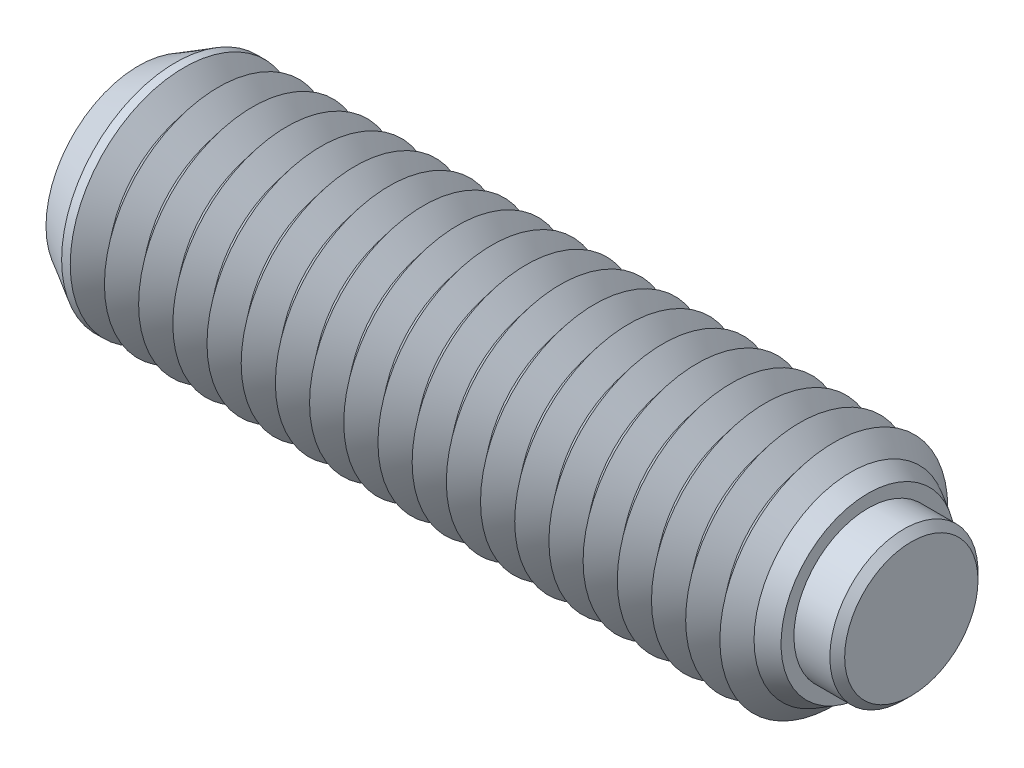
ISO-10303-21;
HEADER;
FILE_DESCRIPTION(('STEP AP214'),'2;1');
FILE_NAME('part.step','',(''),(''),'','','');
FILE_SCHEMA(('AUTOMOTIVE_DESIGN { 1 0 10303 214 1 1 1 1 }'));
ENDSEC;
DATA;
#1=APPLICATION_CONTEXT('core data for automotive mechanical design processes');
#2=APPLICATION_PROTOCOL_DEFINITION('international standard','automotive_design',2000,#1);
#3=PRODUCT_CONTEXT('',#1,'mechanical');
#4=PRODUCT('Part','Part','',(#3));
#5=PRODUCT_RELATED_PRODUCT_CATEGORY('part','',(#4));
#6=PRODUCT_DEFINITION_FORMATION('','',#4);
#7=PRODUCT_DEFINITION_CONTEXT('part definition',#1,'design');
#8=PRODUCT_DEFINITION('design','',#6,#7);
#9=PRODUCT_DEFINITION_SHAPE('','',#8);
#10=(LENGTH_UNIT() NAMED_UNIT(*) SI_UNIT(.MILLI.,.METRE.));
#11=(NAMED_UNIT(*) PLANE_ANGLE_UNIT() SI_UNIT($,.RADIAN.));
#12=(NAMED_UNIT(*) SI_UNIT($,.STERADIAN.) SOLID_ANGLE_UNIT());
#13=UNCERTAINTY_MEASURE_WITH_UNIT(LENGTH_MEASURE(1.E-05),#10,'distance_accuracy_value','');
#14=(GEOMETRIC_REPRESENTATION_CONTEXT(3) GLOBAL_UNCERTAINTY_ASSIGNED_CONTEXT((#13)) GLOBAL_UNIT_ASSIGNED_CONTEXT((#10,
#11,#12)) REPRESENTATION_CONTEXT('',''));
#15=CARTESIAN_POINT('',(0.,0.,0.));
#16=DIRECTION('',(0.,0.,1.));
#17=DIRECTION('',(1.,0.,0.));
#18=AXIS2_PLACEMENT_3D('',#15,#16,#17);
#19=CARTESIAN_POINT('',(2.65,0.,0.));
#20=DIRECTION('',(-1.,0.,0.));
#21=DIRECTION('',(0.,0.,1.));
#22=AXIS2_PLACEMENT_3D('',#19,#20,#21);
#23=CYLINDRICAL_SURFACE('',#22,3.25);
#24=CARTESIAN_POINT('',(2.325,0.,0.));
#25=DIRECTION('',(1.,0.,0.));
#26=DIRECTION('',(0.,0.,-1.));
#27=AXIS2_PLACEMENT_3D('',#24,#25,#26);
#28=CIRCLE('',#27,3.25);
#29=CARTESIAN_POINT('',(2.325,0.,3.25));
#30=VERTEX_POINT('',#29);
#31=EDGE_CURVE('P0_E10',#30,#30,#28,.F.);
#32=CARTESIAN_POINT('',(-1.15,0.,0.));
#33=DIRECTION('',(1.,0.,0.));
#34=DIRECTION('',(0.,0.,-1.));
#35=AXIS2_PLACEMENT_3D('',#32,#33,#34);
#36=CIRCLE('',#35,3.25);
#37=CARTESIAN_POINT('',(-1.15,0.,3.25));
#38=VERTEX_POINT('',#37);
#39=EDGE_CURVE('P0_E25',#38,#38,#36,.T.);
#40=CARTESIAN_POINT('',(2.325,0.,3.25));
#41=CARTESIAN_POINT('',(2.28880208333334,0.,3.25));
#42=CARTESIAN_POINT('',(2.25260416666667,0.,3.25));
#43=CARTESIAN_POINT('',(2.18020833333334,0.,3.25));
#44=CARTESIAN_POINT('',(2.14401041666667,0.,3.25));
#45=CARTESIAN_POINT('',(2.07161458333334,0.,3.25));
#46=CARTESIAN_POINT('',(2.03541666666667,0.,3.25));
#47=CARTESIAN_POINT('',(1.96302083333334,0.,3.25));
#48=CARTESIAN_POINT('',(1.92682291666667,0.,3.25));
#49=CARTESIAN_POINT('',(1.85442708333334,0.,3.25));
#50=CARTESIAN_POINT('',(1.81822916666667,0.,3.25));
#51=CARTESIAN_POINT('',(1.74583333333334,0.,3.25));
#52=CARTESIAN_POINT('',(1.70963541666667,0.,3.25));
#53=CARTESIAN_POINT('',(1.63723958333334,0.,3.25));
#54=CARTESIAN_POINT('',(1.60104166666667,0.,3.25));
#55=CARTESIAN_POINT('',(1.52864583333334,0.,3.25));
#56=CARTESIAN_POINT('',(1.49244791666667,0.,3.25));
#57=CARTESIAN_POINT('',(1.42005208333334,0.,3.25));
#58=CARTESIAN_POINT('',(1.38385416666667,0.,3.25));
#59=CARTESIAN_POINT('',(1.31145833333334,0.,3.25));
#60=CARTESIAN_POINT('',(1.27526041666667,0.,3.25));
#61=CARTESIAN_POINT('',(1.20286458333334,0.,3.25));
#62=CARTESIAN_POINT('',(1.16666666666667,0.,3.25));
#63=CARTESIAN_POINT('',(1.09427083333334,0.,3.25));
#64=CARTESIAN_POINT('',(1.05807291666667,0.,3.25));
#65=CARTESIAN_POINT('',(0.985677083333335,0.,3.25));
#66=CARTESIAN_POINT('',(0.949479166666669,0.,3.25));
#67=CARTESIAN_POINT('',(0.877083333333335,0.,3.25));
#68=CARTESIAN_POINT('',(0.840885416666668,0.,3.25));
#69=CARTESIAN_POINT('',(0.768489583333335,0.,3.25));
#70=CARTESIAN_POINT('',(0.732291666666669,0.,3.25));
#71=CARTESIAN_POINT('',(0.659895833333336,0.,3.25));
#72=CARTESIAN_POINT('',(0.623697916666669,0.,3.25));
#73=CARTESIAN_POINT('',(0.551302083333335,0.,3.25));
#74=CARTESIAN_POINT('',(0.515104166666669,0.,3.25));
#75=CARTESIAN_POINT('',(0.442708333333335,0.,3.25));
#76=CARTESIAN_POINT('',(0.406510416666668,0.,3.25));
#77=CARTESIAN_POINT('',(0.334114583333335,0.,3.25));
#78=CARTESIAN_POINT('',(0.297916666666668,0.,3.25));
#79=CARTESIAN_POINT('',(0.225520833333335,0.,3.25));
#80=CARTESIAN_POINT('',(0.189322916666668,0.,3.25));
#81=CARTESIAN_POINT('',(0.116927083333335,0.,3.25));
#82=CARTESIAN_POINT('',(0.0807291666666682,0.,3.25));
#83=CARTESIAN_POINT('',(0.00833333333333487,0.,3.25));
#84=CARTESIAN_POINT('',(-0.0278645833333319,0.,3.25));
#85=CARTESIAN_POINT('',(-0.100260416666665,0.,3.25));
#86=CARTESIAN_POINT('',(-0.136458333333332,0.,3.25));
#87=CARTESIAN_POINT('',(-0.208854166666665,0.,3.25));
#88=CARTESIAN_POINT('',(-0.245052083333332,0.,3.25));
#89=CARTESIAN_POINT('',(-0.317447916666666,0.,3.25));
#90=CARTESIAN_POINT('',(-0.353645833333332,0.,3.25));
#91=CARTESIAN_POINT('',(-0.426041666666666,0.,3.25));
#92=CARTESIAN_POINT('',(-0.462239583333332,0.,3.25));
#93=CARTESIAN_POINT('',(-0.534635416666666,0.,3.25));
#94=CARTESIAN_POINT('',(-0.570833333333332,0.,3.25));
#95=CARTESIAN_POINT('',(-0.643229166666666,0.,3.25));
#96=CARTESIAN_POINT('',(-0.679427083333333,0.,3.25));
#97=CARTESIAN_POINT('',(-0.751822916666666,0.,3.25));
#98=CARTESIAN_POINT('',(-0.788020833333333,0.,3.25));
#99=CARTESIAN_POINT('',(-0.860416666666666,0.,3.25));
#100=CARTESIAN_POINT('',(-0.896614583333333,0.,3.25));
#101=CARTESIAN_POINT('',(-0.969010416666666,0.,3.25));
#102=CARTESIAN_POINT('',(-1.00520833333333,0.,3.25));
#103=CARTESIAN_POINT('',(-1.07760416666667,0.,3.25));
#104=CARTESIAN_POINT('',(-1.11380208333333,0.,3.25));
#105=CARTESIAN_POINT('',(-1.15,0.,3.25));
#106=B_SPLINE_CURVE_WITH_KNOTS('',3,(#40,#41,#42,#43,#44,#45,#46,#47,#48,#49,#50,#51,#52,#53,
#54,#55,#56,#57,#58,#59,#60,#61,#62,#63,#64,#65,#66,#67,#68,#69,#70,#71,#72,#73,#74,#75,#76,#77,
#78,#79,#80,#81,#82,#83,#84,#85,#86,#87,#88,#89,#90,#91,#92,#93,#94,#95,#96,#97,#98,#99,#100,
#101,#102,#103,#104,#105),.UNSPECIFIED.,.F.,.F.,(4,2,2,2,2,2,2,2,2,2,2,2,2,2,2,2,2,2,2,2,2,2,2,
2,2,2,2,2,2,2,2,2,4),(0.,0.10859375,0.2171875,0.32578125,0.434375,0.54296875,0.6515625,
0.76015625,0.86875,0.977343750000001,1.0859375,1.19453125,1.303125,1.41171875,1.5203125,
1.62890625,1.7375,1.84609375,1.9546875,2.06328125,2.171875,2.28046875,2.3890625,2.49765625,
2.60625,2.71484375,2.8234375,2.93203125,3.040625,3.14921875,3.2578125,3.36640625,3.475),.UNSPECIFIED.);
#107=EDGE_CURVE('P0_BSEAM14',#30,#38,#106,.T.);
#108=ORIENTED_EDGE('',*,*,#31,.T.);
#109=ORIENTED_EDGE('',*,*,#39,.T.);
#110=ORIENTED_EDGE('',*,*,#107,.T.);
#111=ORIENTED_EDGE('',*,*,#107,.F.);
#112=EDGE_LOOP('',(#108,#110,#109,#111));
#113=FACE_BOUND('',#112,.T.);
#114=ADVANCED_FACE('P0_F14',(#113),#23,.T.);
#115=CARTESIAN_POINT('',(2.65,0.,0.));
#116=DIRECTION('',(1.,0.,0.));
#117=DIRECTION('',(0.,0.,-1.));
#118=AXIS2_PLACEMENT_3D('',#115,#116,#117);
#119=PLANE('',#118);
#120=CARTESIAN_POINT('',(2.65,0.,0.));
#121=DIRECTION('',(1.,0.,0.));
#122=DIRECTION('',(0.,0.,-1.));
#123=AXIS2_PLACEMENT_3D('',#120,#121,#122);
#124=CIRCLE('',#123,2.92500000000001);
#125=CARTESIAN_POINT('',(2.65,0.,-2.92500000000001));
#126=VERTEX_POINT('',#125);
#127=EDGE_CURVE('P0_E21',#126,#126,#124,.T.);
#128=ORIENTED_EDGE('',*,*,#127,.T.);
#129=EDGE_LOOP('',(#128));
#130=FACE_BOUND('',#129,.T.);
#131=ADVANCED_FACE('P0_F35',(#130),#119,.T.);
#132=CARTESIAN_POINT('',(-1.15,0.,0.));
#133=DIRECTION('',(1.,0.,0.));
#134=DIRECTION('',(0.,0.,-1.));
#135=AXIS2_PLACEMENT_3D('',#132,#133,#134);
#136=PLANE('',#135);
#137=ORIENTED_EDGE('',*,*,#39,.F.);
#138=EDGE_LOOP('',(#137));
#139=FACE_BOUND('',#138,.T.);
#140=ADVANCED_FACE('P0_F33',(#139),#136,.F.);
#141=CARTESIAN_POINT('',(2.65,0.,0.));
#142=DIRECTION('',(-1.,0.,0.));
#143=DIRECTION('',(0.,0.,1.));
#144=AXIS2_PLACEMENT_3D('',#141,#142,#143);
#145=CONICAL_SURFACE('',#144,2.92500000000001,0.785398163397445);
#146=ORIENTED_EDGE('',*,*,#31,.F.);
#147=EDGE_LOOP('',(#146));
#148=FACE_BOUND('',#147,.T.);
#149=ORIENTED_EDGE('',*,*,#127,.F.);
#150=EDGE_LOOP('',(#149));
#151=FACE_BOUND('',#150,.T.);
#152=ADVANCED_FACE('P0_F16',(#148,#151),#145,.T.);
#153=CLOSED_SHELL('',(#114,#131,#140,#152));
#154=MANIFOLD_SOLID_BREP('P0_B1',#153);
#155=CARTESIAN_POINT('',(-31.25,0.,0.));
#156=DIRECTION('',(1.,0.,0.));
#157=DIRECTION('',(0.,0.,-1.));
#158=AXIS2_PLACEMENT_3D('',#155,#156,#157);
#159=CYLINDRICAL_SURFACE('',#158,5.);
#160=CARTESIAN_POINT('',(-29.25,0.,0.));
#161=DIRECTION('',(1.,0.,0.));
#162=DIRECTION('',(0.,0.,-1.));
#163=AXIS2_PLACEMENT_3D('',#160,#161,#162);
#164=CIRCLE('',#163,5.);
#165=CARTESIAN_POINT('',(-29.25,0.,-5.));
#166=VERTEX_POINT('',#165);
#167=EDGE_CURVE('P1_E226',#166,#166,#164,.T.);
#168=ORIENTED_EDGE('',*,*,#167,.F.);
#169=EDGE_LOOP('',(#168));
#170=FACE_BOUND('',#169,.T.);
#171=CARTESIAN_POINT('',(-29.6275019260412,0.,0.));
#172=DIRECTION('',(1.,0.,0.));
#173=DIRECTION('',(0.,0.,-1.));
#174=AXIS2_PLACEMENT_3D('',#171,#172,#173);
#175=CIRCLE('',#174,5.);
#176=CARTESIAN_POINT('',(-29.6275019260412,0.,-5.));
#177=VERTEX_POINT('',#176);
#178=EDGE_CURVE('P1_E229',#177,#177,#175,.T.);
#179=ORIENTED_EDGE('',*,*,#178,.T.);
#180=EDGE_LOOP('',(#179));
#181=FACE_BOUND('',#180,.T.);
#182=ADVANCED_FACE('P1_F15',(#170,#181),#159,.T.);
#183=CARTESIAN_POINT('',(-1.5,0.,0.));
#184=DIRECTION('',(1.,0.,0.));
#185=DIRECTION('',(0.,0.,-1.));
#186=AXIS2_PLACEMENT_3D('',#183,#184,#185);
#187=CONICAL_SURFACE('',#186,4.06325030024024,0.895664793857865);
#188=CARTESIAN_POINT('',(-0.750000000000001,0.,0.));
#189=DIRECTION('',(1.,0.,0.));
#190=DIRECTION('',(0.,0.,-1.));
#191=AXIS2_PLACEMENT_3D('',#188,#189,#190);
#192=CIRCLE('',#191,5.);
#193=CARTESIAN_POINT('',(-0.750000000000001,0.,-5.));
#194=VERTEX_POINT('',#193);
#195=EDGE_CURVE('P1_E284',#194,#194,#192,.T.);
#196=ORIENTED_EDGE('',*,*,#195,.F.);
#197=EDGE_LOOP('',(#196));
#198=FACE_BOUND('',#197,.T.);
#199=CARTESIAN_POINT('',(-1.5,0.,0.));
#200=DIRECTION('',(1.,0.,0.));
#201=DIRECTION('',(0.,0.,-1.));
#202=AXIS2_PLACEMENT_3D('',#199,#200,#201);
#203=CIRCLE('',#202,4.06325030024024);
#204=CARTESIAN_POINT('',(-1.5,0.,-4.06325030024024));
#205=VERTEX_POINT('',#204);
#206=EDGE_CURVE('P1_E289',#205,#205,#203,.T.);
#207=ORIENTED_EDGE('',*,*,#206,.T.);
#208=EDGE_LOOP('',(#207));
#209=FACE_BOUND('',#208,.T.);
#210=ADVANCED_FACE('P1_F214',(#198,#209),#187,.T.);
#211=CARTESIAN_POINT('',(-2.25,0.,0.));
#212=DIRECTION('',(-1.,0.,0.));
#213=DIRECTION('',(0.,0.,1.));
#214=AXIS2_PLACEMENT_3D('',#211,#212,#213);
#215=CONICAL_SURFACE('',#214,5.,0.895664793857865);
#216=ORIENTED_EDGE('',*,*,#206,.F.);
#217=EDGE_LOOP('',(#216));
#218=FACE_BOUND('',#217,.T.);
#219=CARTESIAN_POINT('',(-2.25,0.,0.));
#220=DIRECTION('',(1.,0.,0.));
#221=DIRECTION('',(0.,0.,-1.));
#222=AXIS2_PLACEMENT_3D('',#219,#220,#221);
#223=CIRCLE('',#222,5.);
#224=CARTESIAN_POINT('',(-2.25,0.,-5.));
#225=VERTEX_POINT('',#224);
#226=EDGE_CURVE('P1_E292',#225,#225,#223,.T.);
#227=ORIENTED_EDGE('',*,*,#226,.T.);
#228=EDGE_LOOP('',(#227));
#229=FACE_BOUND('',#228,.T.);
#230=ADVANCED_FACE('P1_F220',(#218,#229),#215,.T.);
#231=CARTESIAN_POINT('',(-1.15,0.,0.));
#232=DIRECTION('',(1.,0.,0.));
#233=DIRECTION('',(0.,1.,0.));
#234=AXIS2_PLACEMENT_3D('',#231,#232,#233);
#235=PLANE('',#234);
#236=CARTESIAN_POINT('',(-1.15,0.,0.));
#237=DIRECTION('',(1.,0.,0.));
#238=DIRECTION('',(0.,1.,0.));
#239=AXIS2_PLACEMENT_3D('',#236,#237,#238);
#240=CIRCLE('',#239,3.25);
#241=CARTESIAN_POINT('',(-1.15,3.25,0.));
#242=VERTEX_POINT('',#241);
#243=EDGE_CURVE('P1_E279',#242,#242,#240,.T.);
#244=ORIENTED_EDGE('',*,*,#243,.T.);
#245=EDGE_LOOP('',(#244));
#246=FACE_BOUND('',#245,.T.);
#247=ADVANCED_FACE('P1_F549',(#246),#235,.T.);
#248=CARTESIAN_POINT('',(-1.15,0.,0.));
#249=DIRECTION('',(1.,0.,0.));
#250=DIRECTION('',(0.,1.,0.));
#251=AXIS2_PLACEMENT_3D('',#248,#249,#250);
#252=CYLINDRICAL_SURFACE('',#251,3.25);
#253=CARTESIAN_POINT('',(0.75,0.,0.));
#254=DIRECTION('',(1.,0.,0.));
#255=DIRECTION('',(0.,1.,0.));
#256=AXIS2_PLACEMENT_3D('',#253,#254,#255);
#257=CIRCLE('',#256,3.25);
#258=CARTESIAN_POINT('',(0.75,3.25,0.));
#259=VERTEX_POINT('',#258);
#260=EDGE_CURVE('P1_E281',#259,#259,#257,.T.);
#261=CARTESIAN_POINT('',(-1.15,3.25,0.));
#262=CARTESIAN_POINT('',(-1.13020833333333,3.25,0.));
#263=CARTESIAN_POINT('',(-1.11041666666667,3.25,0.));
#264=CARTESIAN_POINT('',(-1.07083333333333,3.25,0.));
#265=CARTESIAN_POINT('',(-1.05104166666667,3.25,0.));
#266=CARTESIAN_POINT('',(-1.01145833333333,3.25,0.));
#267=CARTESIAN_POINT('',(-0.991666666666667,3.25,0.));
#268=CARTESIAN_POINT('',(-0.952083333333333,3.25,0.));
#269=CARTESIAN_POINT('',(-0.932291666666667,3.25,0.));
#270=CARTESIAN_POINT('',(-0.892708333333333,3.25,0.));
#271=CARTESIAN_POINT('',(-0.872916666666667,3.25,0.));
#272=CARTESIAN_POINT('',(-0.833333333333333,3.25,0.));
#273=CARTESIAN_POINT('',(-0.813541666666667,3.25,0.));
#274=CARTESIAN_POINT('',(-0.773958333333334,3.25,0.));
#275=CARTESIAN_POINT('',(-0.754166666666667,3.25,0.));
#276=CARTESIAN_POINT('',(-0.714583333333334,3.25,0.));
#277=CARTESIAN_POINT('',(-0.694791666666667,3.25,0.));
#278=CARTESIAN_POINT('',(-0.655208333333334,3.25,0.));
#279=CARTESIAN_POINT('',(-0.635416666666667,3.25,0.));
#280=CARTESIAN_POINT('',(-0.595833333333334,3.25,0.));
#281=CARTESIAN_POINT('',(-0.576041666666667,3.25,0.));
#282=CARTESIAN_POINT('',(-0.536458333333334,3.25,0.));
#283=CARTESIAN_POINT('',(-0.516666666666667,3.25,0.));
#284=CARTESIAN_POINT('',(-0.477083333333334,3.25,0.));
#285=CARTESIAN_POINT('',(-0.457291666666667,3.25,0.));
#286=CARTESIAN_POINT('',(-0.417708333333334,3.25,0.));
#287=CARTESIAN_POINT('',(-0.397916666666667,3.25,0.));
#288=CARTESIAN_POINT('',(-0.358333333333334,3.25,0.));
#289=CARTESIAN_POINT('',(-0.338541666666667,3.25,0.));
#290=CARTESIAN_POINT('',(-0.298958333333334,3.25,0.));
#291=CARTESIAN_POINT('',(-0.279166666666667,3.25,0.));
#292=CARTESIAN_POINT('',(-0.239583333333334,3.25,0.));
#293=CARTESIAN_POINT('',(-0.219791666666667,3.25,0.));
#294=CARTESIAN_POINT('',(-0.180208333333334,3.25,0.));
#295=CARTESIAN_POINT('',(-0.160416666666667,3.25,0.));
#296=CARTESIAN_POINT('',(-0.120833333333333,3.25,0.));
#297=CARTESIAN_POINT('',(-0.101041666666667,3.25,0.));
#298=CARTESIAN_POINT('',(-0.0614583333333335,3.25,0.));
#299=CARTESIAN_POINT('',(-0.0416666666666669,3.25,0.));
#300=CARTESIAN_POINT('',(-0.00208333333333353,3.25,0.));
#301=CARTESIAN_POINT('',(0.0177083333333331,3.25,0.));
#302=CARTESIAN_POINT('',(0.0572916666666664,3.25,0.));
#303=CARTESIAN_POINT('',(0.0770833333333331,3.25,0.));
#304=CARTESIAN_POINT('',(0.116666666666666,3.25,0.));
#305=CARTESIAN_POINT('',(0.136458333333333,3.25,0.));
#306=CARTESIAN_POINT('',(0.176041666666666,3.25,0.));
#307=CARTESIAN_POINT('',(0.195833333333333,3.25,0.));
#308=CARTESIAN_POINT('',(0.235416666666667,3.25,0.));
#309=CARTESIAN_POINT('',(0.255208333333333,3.25,0.));
#310=CARTESIAN_POINT('',(0.294791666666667,3.25,0.));
#311=CARTESIAN_POINT('',(0.314583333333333,3.25,0.));
#312=CARTESIAN_POINT('',(0.354166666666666,3.25,0.));
#313=CARTESIAN_POINT('',(0.373958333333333,3.25,0.));
#314=CARTESIAN_POINT('',(0.413541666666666,3.25,0.));
#315=CARTESIAN_POINT('',(0.433333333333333,3.25,0.));
#316=CARTESIAN_POINT('',(0.472916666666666,3.25,0.));
#317=CARTESIAN_POINT('',(0.492708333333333,3.25,0.));
#318=CARTESIAN_POINT('',(0.532291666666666,3.25,0.));
#319=CARTESIAN_POINT('',(0.552083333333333,3.25,0.));
#320=CARTESIAN_POINT('',(0.591666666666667,3.25,0.));
#321=CARTESIAN_POINT('',(0.611458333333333,3.25,0.));
#322=CARTESIAN_POINT('',(0.651041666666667,3.25,0.));
#323=CARTESIAN_POINT('',(0.670833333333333,3.25,0.));
#324=CARTESIAN_POINT('',(0.710416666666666,3.25,0.));
#325=CARTESIAN_POINT('',(0.730208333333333,3.25,0.));
#326=CARTESIAN_POINT('',(0.75,3.25,0.));
#327=B_SPLINE_CURVE_WITH_KNOTS('',3,(#261,#262,#263,#264,#265,#266,#267,#268,#269,#270,#271,
#272,#273,#274,#275,#276,#277,#278,#279,#280,#281,#282,#283,#284,#285,#286,#287,#288,#289,#290,
#291,#292,#293,#294,#295,#296,#297,#298,#299,#300,#301,#302,#303,#304,#305,#306,#307,#308,#309,
#310,#311,#312,#313,#314,#315,#316,#317,#318,#319,#320,#321,#322,#323,#324,#325,#326),
.UNSPECIFIED.,.F.,.F.,(4,2,2,2,2,2,2,2,2,2,2,2,2,2,2,2,2,2,2,2,2,2,2,2,2,2,2,2,2,2,2,2,4),(0.,
0.059375,0.11875,0.178125,0.2375,0.296875,0.35625,0.415625,0.475,0.534375,0.59375,0.653125,
0.7125,0.771875,0.83125,0.890625,0.95,1.009375,1.06875,1.128125,1.1875,1.246875,1.30625,
1.365625,1.425,1.484375,1.54375,1.603125,1.6625,1.721875,1.78125,1.840625,1.9),.UNSPECIFIED.);
#328=EDGE_CURVE('P1_BSEAM210',#242,#259,#327,.T.);
#329=ORIENTED_EDGE('',*,*,#243,.F.);
#330=ORIENTED_EDGE('',*,*,#260,.T.);
#331=ORIENTED_EDGE('',*,*,#328,.T.);
#332=ORIENTED_EDGE('',*,*,#328,.F.);
#333=EDGE_LOOP('',(#329,#331,#330,#332));
#334=FACE_BOUND('',#333,.T.);
#335=ADVANCED_FACE('P1_F210',(#334),#252,.F.);
#336=CARTESIAN_POINT('',(0.75,3.81698729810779,0.));
#337=DIRECTION('',(1.,0.,0.));
#338=DIRECTION('',(0.,1.,0.));
#339=AXIS2_PLACEMENT_3D('',#336,#337,#338);
#340=PLANE('',#339);
#341=ORIENTED_EDGE('',*,*,#260,.F.);
#342=EDGE_LOOP('',(#341));
#343=FACE_BOUND('',#342,.T.);
#344=CARTESIAN_POINT('',(0.75,0.,0.));
#345=DIRECTION('',(1.,0.,0.));
#346=DIRECTION('',(0.,1.,0.));
#347=AXIS2_PLACEMENT_3D('',#344,#345,#346);
#348=CIRCLE('',#347,3.81698729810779);
#349=CARTESIAN_POINT('',(0.75,3.81698729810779,0.));
#350=VERTEX_POINT('',#349);
#351=EDGE_CURVE('P1_E121',#350,#350,#348,.T.);
#352=ORIENTED_EDGE('',*,*,#351,.T.);
#353=EDGE_LOOP('',(#352));
#354=FACE_BOUND('',#353,.T.);
#355=ADVANCED_FACE('P1_F206',(#343,#354),#340,.T.);
#356=CARTESIAN_POINT('',(0.75,0.,0.));
#357=DIRECTION('',(-1.,0.,0.));
#358=DIRECTION('',(0.,-1.,0.));
#359=AXIS2_PLACEMENT_3D('',#356,#357,#358);
#360=CONICAL_SURFACE('',#359,3.81698729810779,0.523598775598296);
#361=CARTESIAN_POINT('',(0.,0.,0.));
#362=DIRECTION('',(1.,0.,0.));
#363=DIRECTION('',(0.,0.,-1.));
#364=AXIS2_PLACEMENT_3D('',#361,#362,#363);
#365=CIRCLE('',#364,4.25);
#366=CARTESIAN_POINT('',(0.,0.,-4.25));
#367=VERTEX_POINT('',#366);
#368=EDGE_CURVE('P1_E236',#367,#367,#365,.T.);
#369=ORIENTED_EDGE('',*,*,#368,.T.);
#370=EDGE_LOOP('',(#369));
#371=FACE_BOUND('',#370,.T.);
#372=ORIENTED_EDGE('',*,*,#351,.F.);
#373=EDGE_LOOP('',(#372));
#374=FACE_BOUND('',#373,.T.);
#375=ADVANCED_FACE('P1_F203',(#371,#374),#360,.T.);
#376=CARTESIAN_POINT('',(0.,0.,0.));
#377=DIRECTION('',(-1.,0.,0.));
#378=DIRECTION('',(0.,0.,1.));
#379=AXIS2_PLACEMENT_3D('',#376,#377,#378);
#380=CONICAL_SURFACE('',#379,4.25,0.785398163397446);
#381=ORIENTED_EDGE('',*,*,#195,.T.);
#382=EDGE_LOOP('',(#381));
#383=FACE_BOUND('',#382,.T.);
#384=ORIENTED_EDGE('',*,*,#368,.F.);
#385=EDGE_LOOP('',(#384));
#386=FACE_BOUND('',#385,.T.);
#387=ADVANCED_FACE('P1_F17',(#383,#386),#380,.T.);
#388=CARTESIAN_POINT('',(-3.,0.,0.));
#389=DIRECTION('',(1.,0.,0.));
#390=DIRECTION('',(0.,0.,-1.));
#391=AXIS2_PLACEMENT_3D('',#388,#389,#390);
#392=CONICAL_SURFACE('',#391,4.06325030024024,0.895664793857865);
#393=ORIENTED_EDGE('',*,*,#226,.F.);
#394=EDGE_LOOP('',(#393));
#395=FACE_BOUND('',#394,.T.);
#396=CARTESIAN_POINT('',(-3.,0.,0.));
#397=DIRECTION('',(1.,0.,0.));
#398=DIRECTION('',(0.,0.,-1.));
#399=AXIS2_PLACEMENT_3D('',#396,#397,#398);
#400=CIRCLE('',#399,4.06325030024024);
#401=CARTESIAN_POINT('',(-3.,0.,-4.06325030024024));
#402=VERTEX_POINT('',#401);
#403=EDGE_CURVE('P1_E295',#402,#402,#400,.T.);
#404=ORIENTED_EDGE('',*,*,#403,.T.);
#405=EDGE_LOOP('',(#404));
#406=FACE_BOUND('',#405,.T.);
#407=ADVANCED_FACE('P1_F543',(#395,#406),#392,.T.);
#408=CARTESIAN_POINT('',(-3.75,0.,0.));
#409=DIRECTION('',(-1.,0.,0.));
#410=DIRECTION('',(0.,0.,1.));
#411=AXIS2_PLACEMENT_3D('',#408,#409,#410);
#412=CONICAL_SURFACE('',#411,5.,0.895664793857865);
#413=ORIENTED_EDGE('',*,*,#403,.F.);
#414=EDGE_LOOP('',(#413));
#415=FACE_BOUND('',#414,.T.);
#416=CARTESIAN_POINT('',(-3.75,0.,0.));
#417=DIRECTION('',(1.,0.,0.));
#418=DIRECTION('',(0.,0.,-1.));
#419=AXIS2_PLACEMENT_3D('',#416,#417,#418);
#420=CIRCLE('',#419,5.);
#421=CARTESIAN_POINT('',(-3.75,0.,-5.));
#422=VERTEX_POINT('',#421);
#423=EDGE_CURVE('P1_E298',#422,#422,#420,.T.);
#424=ORIENTED_EDGE('',*,*,#423,.T.);
#425=EDGE_LOOP('',(#424));
#426=FACE_BOUND('',#425,.T.);
#427=ADVANCED_FACE('P1_F539',(#415,#426),#412,.T.);
#428=CARTESIAN_POINT('',(-4.5,0.,0.));
#429=DIRECTION('',(1.,0.,0.));
#430=DIRECTION('',(0.,0.,-1.));
#431=AXIS2_PLACEMENT_3D('',#428,#429,#430);
#432=CONICAL_SURFACE('',#431,4.06325030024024,0.895664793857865);
#433=ORIENTED_EDGE('',*,*,#423,.F.);
#434=EDGE_LOOP('',(#433));
#435=FACE_BOUND('',#434,.T.);
#436=CARTESIAN_POINT('',(-4.5,0.,0.));
#437=DIRECTION('',(1.,0.,0.));
#438=DIRECTION('',(0.,0.,-1.));
#439=AXIS2_PLACEMENT_3D('',#436,#437,#438);
#440=CIRCLE('',#439,4.06325030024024);
#441=CARTESIAN_POINT('',(-4.5,0.,-4.06325030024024));
#442=VERTEX_POINT('',#441);
#443=EDGE_CURVE('P1_E301',#442,#442,#440,.T.);
#444=ORIENTED_EDGE('',*,*,#443,.T.);
#445=EDGE_LOOP('',(#444));
#446=FACE_BOUND('',#445,.T.);
#447=ADVANCED_FACE('P1_F535',(#435,#446),#432,.T.);
#448=CARTESIAN_POINT('',(-5.25,0.,0.));
#449=DIRECTION('',(-1.,0.,0.));
#450=DIRECTION('',(0.,0.,1.));
#451=AXIS2_PLACEMENT_3D('',#448,#449,#450);
#452=CONICAL_SURFACE('',#451,5.,0.895664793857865);
#453=ORIENTED_EDGE('',*,*,#443,.F.);
#454=EDGE_LOOP('',(#453));
#455=FACE_BOUND('',#454,.T.);
#456=CARTESIAN_POINT('',(-5.25,0.,0.));
#457=DIRECTION('',(1.,0.,0.));
#458=DIRECTION('',(0.,0.,-1.));
#459=AXIS2_PLACEMENT_3D('',#456,#457,#458);
#460=CIRCLE('',#459,5.);
#461=CARTESIAN_POINT('',(-5.25,0.,-5.));
#462=VERTEX_POINT('',#461);
#463=EDGE_CURVE('P1_E304',#462,#462,#460,.T.);
#464=ORIENTED_EDGE('',*,*,#463,.T.);
#465=EDGE_LOOP('',(#464));
#466=FACE_BOUND('',#465,.T.);
#467=ADVANCED_FACE('P1_F531',(#455,#466),#452,.T.);
#468=CARTESIAN_POINT('',(-6.,0.,0.));
#469=DIRECTION('',(1.,0.,0.));
#470=DIRECTION('',(0.,0.,-1.));
#471=AXIS2_PLACEMENT_3D('',#468,#469,#470);
#472=CONICAL_SURFACE('',#471,4.06325030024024,0.895664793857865);
#473=ORIENTED_EDGE('',*,*,#463,.F.);
#474=EDGE_LOOP('',(#473));
#475=FACE_BOUND('',#474,.T.);
#476=CARTESIAN_POINT('',(-6.,0.,0.));
#477=DIRECTION('',(1.,0.,0.));
#478=DIRECTION('',(0.,0.,-1.));
#479=AXIS2_PLACEMENT_3D('',#476,#477,#478);
#480=CIRCLE('',#479,4.06325030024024);
#481=CARTESIAN_POINT('',(-6.,0.,-4.06325030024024));
#482=VERTEX_POINT('',#481);
#483=EDGE_CURVE('P1_E307',#482,#482,#480,.T.);
#484=ORIENTED_EDGE('',*,*,#483,.T.);
#485=EDGE_LOOP('',(#484));
#486=FACE_BOUND('',#485,.T.);
#487=ADVANCED_FACE('P1_F527',(#475,#486),#472,.T.);
#488=CARTESIAN_POINT('',(-6.75,0.,0.));
#489=DIRECTION('',(-1.,0.,0.));
#490=DIRECTION('',(0.,0.,1.));
#491=AXIS2_PLACEMENT_3D('',#488,#489,#490);
#492=CONICAL_SURFACE('',#491,5.,0.895664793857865);
#493=ORIENTED_EDGE('',*,*,#483,.F.);
#494=EDGE_LOOP('',(#493));
#495=FACE_BOUND('',#494,.T.);
#496=CARTESIAN_POINT('',(-6.75,0.,0.));
#497=DIRECTION('',(1.,0.,0.));
#498=DIRECTION('',(0.,0.,-1.));
#499=AXIS2_PLACEMENT_3D('',#496,#497,#498);
#500=CIRCLE('',#499,5.);
#501=CARTESIAN_POINT('',(-6.75,0.,-5.));
#502=VERTEX_POINT('',#501);
#503=EDGE_CURVE('P1_E310',#502,#502,#500,.T.);
#504=ORIENTED_EDGE('',*,*,#503,.T.);
#505=EDGE_LOOP('',(#504));
#506=FACE_BOUND('',#505,.T.);
#507=ADVANCED_FACE('P1_F523',(#495,#506),#492,.T.);
#508=CARTESIAN_POINT('',(-7.5,0.,0.));
#509=DIRECTION('',(1.,0.,0.));
#510=DIRECTION('',(0.,0.,-1.));
#511=AXIS2_PLACEMENT_3D('',#508,#509,#510);
#512=CONICAL_SURFACE('',#511,4.06325030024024,0.895664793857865);
#513=ORIENTED_EDGE('',*,*,#503,.F.);
#514=EDGE_LOOP('',(#513));
#515=FACE_BOUND('',#514,.T.);
#516=CARTESIAN_POINT('',(-7.5,0.,0.));
#517=DIRECTION('',(1.,0.,0.));
#518=DIRECTION('',(0.,0.,-1.));
#519=AXIS2_PLACEMENT_3D('',#516,#517,#518);
#520=CIRCLE('',#519,4.06325030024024);
#521=CARTESIAN_POINT('',(-7.5,0.,-4.06325030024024));
#522=VERTEX_POINT('',#521);
#523=EDGE_CURVE('P1_E313',#522,#522,#520,.T.);
#524=ORIENTED_EDGE('',*,*,#523,.T.);
#525=EDGE_LOOP('',(#524));
#526=FACE_BOUND('',#525,.T.);
#527=ADVANCED_FACE('P1_F519',(#515,#526),#512,.T.);
#528=CARTESIAN_POINT('',(-8.25,0.,0.));
#529=DIRECTION('',(-1.,0.,0.));
#530=DIRECTION('',(0.,0.,1.));
#531=AXIS2_PLACEMENT_3D('',#528,#529,#530);
#532=CONICAL_SURFACE('',#531,5.,0.895664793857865);
#533=ORIENTED_EDGE('',*,*,#523,.F.);
#534=EDGE_LOOP('',(#533));
#535=FACE_BOUND('',#534,.T.);
#536=CARTESIAN_POINT('',(-8.25,0.,0.));
#537=DIRECTION('',(1.,0.,0.));
#538=DIRECTION('',(0.,0.,-1.));
#539=AXIS2_PLACEMENT_3D('',#536,#537,#538);
#540=CIRCLE('',#539,5.);
#541=CARTESIAN_POINT('',(-8.25,0.,-5.));
#542=VERTEX_POINT('',#541);
#543=EDGE_CURVE('P1_E316',#542,#542,#540,.T.);
#544=ORIENTED_EDGE('',*,*,#543,.T.);
#545=EDGE_LOOP('',(#544));
#546=FACE_BOUND('',#545,.T.);
#547=ADVANCED_FACE('P1_F515',(#535,#546),#532,.T.);
#548=CARTESIAN_POINT('',(-9.,0.,0.));
#549=DIRECTION('',(1.,0.,0.));
#550=DIRECTION('',(0.,0.,-1.));
#551=AXIS2_PLACEMENT_3D('',#548,#549,#550);
#552=CONICAL_SURFACE('',#551,4.06325030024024,0.895664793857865);
#553=ORIENTED_EDGE('',*,*,#543,.F.);
#554=EDGE_LOOP('',(#553));
#555=FACE_BOUND('',#554,.T.);
#556=CARTESIAN_POINT('',(-9.,0.,0.));
#557=DIRECTION('',(1.,0.,0.));
#558=DIRECTION('',(0.,0.,-1.));
#559=AXIS2_PLACEMENT_3D('',#556,#557,#558);
#560=CIRCLE('',#559,4.06325030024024);
#561=CARTESIAN_POINT('',(-9.,0.,-4.06325030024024));
#562=VERTEX_POINT('',#561);
#563=EDGE_CURVE('P1_E319',#562,#562,#560,.T.);
#564=ORIENTED_EDGE('',*,*,#563,.T.);
#565=EDGE_LOOP('',(#564));
#566=FACE_BOUND('',#565,.T.);
#567=ADVANCED_FACE('P1_F511',(#555,#566),#552,.T.);
#568=CARTESIAN_POINT('',(-9.75,0.,0.));
#569=DIRECTION('',(-1.,0.,0.));
#570=DIRECTION('',(0.,0.,1.));
#571=AXIS2_PLACEMENT_3D('',#568,#569,#570);
#572=CONICAL_SURFACE('',#571,5.,0.895664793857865);
#573=ORIENTED_EDGE('',*,*,#563,.F.);
#574=EDGE_LOOP('',(#573));
#575=FACE_BOUND('',#574,.T.);
#576=CARTESIAN_POINT('',(-9.75,0.,0.));
#577=DIRECTION('',(1.,0.,0.));
#578=DIRECTION('',(0.,0.,-1.));
#579=AXIS2_PLACEMENT_3D('',#576,#577,#578);
#580=CIRCLE('',#579,5.);
#581=CARTESIAN_POINT('',(-9.75,0.,-5.));
#582=VERTEX_POINT('',#581);
#583=EDGE_CURVE('P1_E322',#582,#582,#580,.T.);
#584=ORIENTED_EDGE('',*,*,#583,.T.);
#585=EDGE_LOOP('',(#584));
#586=FACE_BOUND('',#585,.T.);
#587=ADVANCED_FACE('P1_F507',(#575,#586),#572,.T.);
#588=CARTESIAN_POINT('',(-10.5,0.,0.));
#589=DIRECTION('',(1.,0.,0.));
#590=DIRECTION('',(0.,0.,-1.));
#591=AXIS2_PLACEMENT_3D('',#588,#589,#590);
#592=CONICAL_SURFACE('',#591,4.06325030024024,0.895664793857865);
#593=ORIENTED_EDGE('',*,*,#583,.F.);
#594=EDGE_LOOP('',(#593));
#595=FACE_BOUND('',#594,.T.);
#596=CARTESIAN_POINT('',(-10.5,0.,0.));
#597=DIRECTION('',(1.,0.,0.));
#598=DIRECTION('',(0.,0.,-1.));
#599=AXIS2_PLACEMENT_3D('',#596,#597,#598);
#600=CIRCLE('',#599,4.06325030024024);
#601=CARTESIAN_POINT('',(-10.5,0.,-4.06325030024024));
#602=VERTEX_POINT('',#601);
#603=EDGE_CURVE('P1_E325',#602,#602,#600,.T.);
#604=ORIENTED_EDGE('',*,*,#603,.T.);
#605=EDGE_LOOP('',(#604));
#606=FACE_BOUND('',#605,.T.);
#607=ADVANCED_FACE('P1_F503',(#595,#606),#592,.T.);
#608=CARTESIAN_POINT('',(-11.25,0.,0.));
#609=DIRECTION('',(-1.,0.,0.));
#610=DIRECTION('',(0.,0.,1.));
#611=AXIS2_PLACEMENT_3D('',#608,#609,#610);
#612=CONICAL_SURFACE('',#611,5.,0.895664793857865);
#613=ORIENTED_EDGE('',*,*,#603,.F.);
#614=EDGE_LOOP('',(#613));
#615=FACE_BOUND('',#614,.T.);
#616=CARTESIAN_POINT('',(-11.25,0.,0.));
#617=DIRECTION('',(1.,0.,0.));
#618=DIRECTION('',(0.,0.,-1.));
#619=AXIS2_PLACEMENT_3D('',#616,#617,#618);
#620=CIRCLE('',#619,5.);
#621=CARTESIAN_POINT('',(-11.25,0.,-5.));
#622=VERTEX_POINT('',#621);
#623=EDGE_CURVE('P1_E328',#622,#622,#620,.T.);
#624=ORIENTED_EDGE('',*,*,#623,.T.);
#625=EDGE_LOOP('',(#624));
#626=FACE_BOUND('',#625,.T.);
#627=ADVANCED_FACE('P1_F499',(#615,#626),#612,.T.);
#628=CARTESIAN_POINT('',(-12.,0.,0.));
#629=DIRECTION('',(1.,0.,0.));
#630=DIRECTION('',(0.,0.,-1.));
#631=AXIS2_PLACEMENT_3D('',#628,#629,#630);
#632=CONICAL_SURFACE('',#631,4.06325030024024,0.895664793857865);
#633=ORIENTED_EDGE('',*,*,#623,.F.);
#634=EDGE_LOOP('',(#633));
#635=FACE_BOUND('',#634,.T.);
#636=CARTESIAN_POINT('',(-12.,0.,0.));
#637=DIRECTION('',(1.,0.,0.));
#638=DIRECTION('',(0.,0.,-1.));
#639=AXIS2_PLACEMENT_3D('',#636,#637,#638);
#640=CIRCLE('',#639,4.06325030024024);
#641=CARTESIAN_POINT('',(-12.,0.,-4.06325030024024));
#642=VERTEX_POINT('',#641);
#643=EDGE_CURVE('P1_E331',#642,#642,#640,.T.);
#644=ORIENTED_EDGE('',*,*,#643,.T.);
#645=EDGE_LOOP('',(#644));
#646=FACE_BOUND('',#645,.T.);
#647=ADVANCED_FACE('P1_F495',(#635,#646),#632,.T.);
#648=CARTESIAN_POINT('',(-12.75,0.,0.));
#649=DIRECTION('',(-1.,0.,0.));
#650=DIRECTION('',(0.,0.,1.));
#651=AXIS2_PLACEMENT_3D('',#648,#649,#650);
#652=CONICAL_SURFACE('',#651,5.,0.895664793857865);
#653=ORIENTED_EDGE('',*,*,#643,.F.);
#654=EDGE_LOOP('',(#653));
#655=FACE_BOUND('',#654,.T.);
#656=CARTESIAN_POINT('',(-12.75,0.,0.));
#657=DIRECTION('',(1.,0.,0.));
#658=DIRECTION('',(0.,0.,-1.));
#659=AXIS2_PLACEMENT_3D('',#656,#657,#658);
#660=CIRCLE('',#659,5.);
#661=CARTESIAN_POINT('',(-12.75,0.,-5.));
#662=VERTEX_POINT('',#661);
#663=EDGE_CURVE('P1_E334',#662,#662,#660,.T.);
#664=ORIENTED_EDGE('',*,*,#663,.T.);
#665=EDGE_LOOP('',(#664));
#666=FACE_BOUND('',#665,.T.);
#667=ADVANCED_FACE('P1_F491',(#655,#666),#652,.T.);
#668=CARTESIAN_POINT('',(-13.5,0.,0.));
#669=DIRECTION('',(1.,0.,0.));
#670=DIRECTION('',(0.,0.,-1.));
#671=AXIS2_PLACEMENT_3D('',#668,#669,#670);
#672=CONICAL_SURFACE('',#671,4.06325030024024,0.895664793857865);
#673=ORIENTED_EDGE('',*,*,#663,.F.);
#674=EDGE_LOOP('',(#673));
#675=FACE_BOUND('',#674,.T.);
#676=CARTESIAN_POINT('',(-13.5,0.,0.));
#677=DIRECTION('',(1.,0.,0.));
#678=DIRECTION('',(0.,0.,-1.));
#679=AXIS2_PLACEMENT_3D('',#676,#677,#678);
#680=CIRCLE('',#679,4.06325030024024);
#681=CARTESIAN_POINT('',(-13.5,0.,-4.06325030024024));
#682=VERTEX_POINT('',#681);
#683=EDGE_CURVE('P1_E337',#682,#682,#680,.T.);
#684=ORIENTED_EDGE('',*,*,#683,.T.);
#685=EDGE_LOOP('',(#684));
#686=FACE_BOUND('',#685,.T.);
#687=ADVANCED_FACE('P1_F487',(#675,#686),#672,.T.);
#688=CARTESIAN_POINT('',(-14.25,0.,0.));
#689=DIRECTION('',(-1.,0.,0.));
#690=DIRECTION('',(0.,0.,1.));
#691=AXIS2_PLACEMENT_3D('',#688,#689,#690);
#692=CONICAL_SURFACE('',#691,5.,0.895664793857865);
#693=ORIENTED_EDGE('',*,*,#683,.F.);
#694=EDGE_LOOP('',(#693));
#695=FACE_BOUND('',#694,.T.);
#696=CARTESIAN_POINT('',(-14.25,0.,0.));
#697=DIRECTION('',(1.,0.,0.));
#698=DIRECTION('',(0.,0.,-1.));
#699=AXIS2_PLACEMENT_3D('',#696,#697,#698);
#700=CIRCLE('',#699,5.);
#701=CARTESIAN_POINT('',(-14.25,0.,-5.));
#702=VERTEX_POINT('',#701);
#703=EDGE_CURVE('P1_E340',#702,#702,#700,.T.);
#704=ORIENTED_EDGE('',*,*,#703,.T.);
#705=EDGE_LOOP('',(#704));
#706=FACE_BOUND('',#705,.T.);
#707=ADVANCED_FACE('P1_F483',(#695,#706),#692,.T.);
#708=CARTESIAN_POINT('',(-15.,0.,0.));
#709=DIRECTION('',(1.,0.,0.));
#710=DIRECTION('',(0.,0.,-1.));
#711=AXIS2_PLACEMENT_3D('',#708,#709,#710);
#712=CONICAL_SURFACE('',#711,4.06325030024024,0.895664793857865);
#713=ORIENTED_EDGE('',*,*,#703,.F.);
#714=EDGE_LOOP('',(#713));
#715=FACE_BOUND('',#714,.T.);
#716=CARTESIAN_POINT('',(-15.,0.,0.));
#717=DIRECTION('',(1.,0.,0.));
#718=DIRECTION('',(0.,0.,-1.));
#719=AXIS2_PLACEMENT_3D('',#716,#717,#718);
#720=CIRCLE('',#719,4.06325030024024);
#721=CARTESIAN_POINT('',(-15.,0.,-4.06325030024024));
#722=VERTEX_POINT('',#721);
#723=EDGE_CURVE('P1_E343',#722,#722,#720,.T.);
#724=ORIENTED_EDGE('',*,*,#723,.T.);
#725=EDGE_LOOP('',(#724));
#726=FACE_BOUND('',#725,.T.);
#727=ADVANCED_FACE('P1_F479',(#715,#726),#712,.T.);
#728=CARTESIAN_POINT('',(-15.75,0.,0.));
#729=DIRECTION('',(-1.,0.,0.));
#730=DIRECTION('',(0.,0.,1.));
#731=AXIS2_PLACEMENT_3D('',#728,#729,#730);
#732=CONICAL_SURFACE('',#731,5.,0.895664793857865);
#733=ORIENTED_EDGE('',*,*,#723,.F.);
#734=EDGE_LOOP('',(#733));
#735=FACE_BOUND('',#734,.T.);
#736=CARTESIAN_POINT('',(-15.75,0.,0.));
#737=DIRECTION('',(1.,0.,0.));
#738=DIRECTION('',(0.,0.,-1.));
#739=AXIS2_PLACEMENT_3D('',#736,#737,#738);
#740=CIRCLE('',#739,5.);
#741=CARTESIAN_POINT('',(-15.75,0.,-5.));
#742=VERTEX_POINT('',#741);
#743=EDGE_CURVE('P1_E346',#742,#742,#740,.T.);
#744=ORIENTED_EDGE('',*,*,#743,.T.);
#745=EDGE_LOOP('',(#744));
#746=FACE_BOUND('',#745,.T.);
#747=ADVANCED_FACE('P1_F475',(#735,#746),#732,.T.);
#748=CARTESIAN_POINT('',(-16.5,0.,0.));
#749=DIRECTION('',(1.,0.,0.));
#750=DIRECTION('',(0.,0.,-1.));
#751=AXIS2_PLACEMENT_3D('',#748,#749,#750);
#752=CONICAL_SURFACE('',#751,4.06325030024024,0.895664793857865);
#753=ORIENTED_EDGE('',*,*,#743,.F.);
#754=EDGE_LOOP('',(#753));
#755=FACE_BOUND('',#754,.T.);
#756=CARTESIAN_POINT('',(-16.5,0.,0.));
#757=DIRECTION('',(1.,0.,0.));
#758=DIRECTION('',(0.,0.,-1.));
#759=AXIS2_PLACEMENT_3D('',#756,#757,#758);
#760=CIRCLE('',#759,4.06325030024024);
#761=CARTESIAN_POINT('',(-16.5,0.,-4.06325030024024));
#762=VERTEX_POINT('',#761);
#763=EDGE_CURVE('P1_E349',#762,#762,#760,.T.);
#764=ORIENTED_EDGE('',*,*,#763,.T.);
#765=EDGE_LOOP('',(#764));
#766=FACE_BOUND('',#765,.T.);
#767=ADVANCED_FACE('P1_F471',(#755,#766),#752,.T.);
#768=CARTESIAN_POINT('',(-17.25,0.,0.));
#769=DIRECTION('',(-1.,0.,0.));
#770=DIRECTION('',(0.,0.,1.));
#771=AXIS2_PLACEMENT_3D('',#768,#769,#770);
#772=CONICAL_SURFACE('',#771,5.,0.895664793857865);
#773=ORIENTED_EDGE('',*,*,#763,.F.);
#774=EDGE_LOOP('',(#773));
#775=FACE_BOUND('',#774,.T.);
#776=CARTESIAN_POINT('',(-17.25,0.,0.));
#777=DIRECTION('',(1.,0.,0.));
#778=DIRECTION('',(0.,0.,-1.));
#779=AXIS2_PLACEMENT_3D('',#776,#777,#778);
#780=CIRCLE('',#779,5.);
#781=CARTESIAN_POINT('',(-17.25,0.,-5.));
#782=VERTEX_POINT('',#781);
#783=EDGE_CURVE('P1_E352',#782,#782,#780,.T.);
#784=ORIENTED_EDGE('',*,*,#783,.T.);
#785=EDGE_LOOP('',(#784));
#786=FACE_BOUND('',#785,.T.);
#787=ADVANCED_FACE('P1_F467',(#775,#786),#772,.T.);
#788=CARTESIAN_POINT('',(-18.,0.,0.));
#789=DIRECTION('',(1.,0.,0.));
#790=DIRECTION('',(0.,0.,-1.));
#791=AXIS2_PLACEMENT_3D('',#788,#789,#790);
#792=CONICAL_SURFACE('',#791,4.06325030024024,0.895664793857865);
#793=ORIENTED_EDGE('',*,*,#783,.F.);
#794=EDGE_LOOP('',(#793));
#795=FACE_BOUND('',#794,.T.);
#796=CARTESIAN_POINT('',(-18.,0.,0.));
#797=DIRECTION('',(1.,0.,0.));
#798=DIRECTION('',(0.,0.,-1.));
#799=AXIS2_PLACEMENT_3D('',#796,#797,#798);
#800=CIRCLE('',#799,4.06325030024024);
#801=CARTESIAN_POINT('',(-18.,0.,-4.06325030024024));
#802=VERTEX_POINT('',#801);
#803=EDGE_CURVE('P1_E355',#802,#802,#800,.T.);
#804=ORIENTED_EDGE('',*,*,#803,.T.);
#805=EDGE_LOOP('',(#804));
#806=FACE_BOUND('',#805,.T.);
#807=ADVANCED_FACE('P1_F463',(#795,#806),#792,.T.);
#808=CARTESIAN_POINT('',(-18.75,0.,0.));
#809=DIRECTION('',(-1.,0.,0.));
#810=DIRECTION('',(0.,0.,1.));
#811=AXIS2_PLACEMENT_3D('',#808,#809,#810);
#812=CONICAL_SURFACE('',#811,5.,0.895664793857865);
#813=ORIENTED_EDGE('',*,*,#803,.F.);
#814=EDGE_LOOP('',(#813));
#815=FACE_BOUND('',#814,.T.);
#816=CARTESIAN_POINT('',(-18.75,0.,0.));
#817=DIRECTION('',(1.,0.,0.));
#818=DIRECTION('',(0.,0.,-1.));
#819=AXIS2_PLACEMENT_3D('',#816,#817,#818);
#820=CIRCLE('',#819,5.);
#821=CARTESIAN_POINT('',(-18.75,0.,-5.));
#822=VERTEX_POINT('',#821);
#823=EDGE_CURVE('P1_E358',#822,#822,#820,.T.);
#824=ORIENTED_EDGE('',*,*,#823,.T.);
#825=EDGE_LOOP('',(#824));
#826=FACE_BOUND('',#825,.T.);
#827=ADVANCED_FACE('P1_F459',(#815,#826),#812,.T.);
#828=CARTESIAN_POINT('',(-19.5,0.,0.));
#829=DIRECTION('',(1.,0.,0.));
#830=DIRECTION('',(0.,0.,-1.));
#831=AXIS2_PLACEMENT_3D('',#828,#829,#830);
#832=CONICAL_SURFACE('',#831,4.06325030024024,0.895664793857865);
#833=ORIENTED_EDGE('',*,*,#823,.F.);
#834=EDGE_LOOP('',(#833));
#835=FACE_BOUND('',#834,.T.);
#836=CARTESIAN_POINT('',(-19.5,0.,0.));
#837=DIRECTION('',(1.,0.,0.));
#838=DIRECTION('',(0.,0.,-1.));
#839=AXIS2_PLACEMENT_3D('',#836,#837,#838);
#840=CIRCLE('',#839,4.06325030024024);
#841=CARTESIAN_POINT('',(-19.5,0.,-4.06325030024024));
#842=VERTEX_POINT('',#841);
#843=EDGE_CURVE('P1_E361',#842,#842,#840,.T.);
#844=ORIENTED_EDGE('',*,*,#843,.T.);
#845=EDGE_LOOP('',(#844));
#846=FACE_BOUND('',#845,.T.);
#847=ADVANCED_FACE('P1_F455',(#835,#846),#832,.T.);
#848=CARTESIAN_POINT('',(-20.25,0.,0.));
#849=DIRECTION('',(-1.,0.,0.));
#850=DIRECTION('',(0.,0.,1.));
#851=AXIS2_PLACEMENT_3D('',#848,#849,#850);
#852=CONICAL_SURFACE('',#851,5.,0.895664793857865);
#853=ORIENTED_EDGE('',*,*,#843,.F.);
#854=EDGE_LOOP('',(#853));
#855=FACE_BOUND('',#854,.T.);
#856=CARTESIAN_POINT('',(-20.25,0.,0.));
#857=DIRECTION('',(1.,0.,0.));
#858=DIRECTION('',(0.,0.,-1.));
#859=AXIS2_PLACEMENT_3D('',#856,#857,#858);
#860=CIRCLE('',#859,5.);
#861=CARTESIAN_POINT('',(-20.25,0.,-5.));
#862=VERTEX_POINT('',#861);
#863=EDGE_CURVE('P1_E364',#862,#862,#860,.T.);
#864=ORIENTED_EDGE('',*,*,#863,.T.);
#865=EDGE_LOOP('',(#864));
#866=FACE_BOUND('',#865,.T.);
#867=ADVANCED_FACE('P1_F451',(#855,#866),#852,.T.);
#868=CARTESIAN_POINT('',(-21.,0.,0.));
#869=DIRECTION('',(1.,0.,0.));
#870=DIRECTION('',(0.,0.,-1.));
#871=AXIS2_PLACEMENT_3D('',#868,#869,#870);
#872=CONICAL_SURFACE('',#871,4.06325030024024,0.895664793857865);
#873=ORIENTED_EDGE('',*,*,#863,.F.);
#874=EDGE_LOOP('',(#873));
#875=FACE_BOUND('',#874,.T.);
#876=CARTESIAN_POINT('',(-21.,0.,0.));
#877=DIRECTION('',(1.,0.,0.));
#878=DIRECTION('',(0.,0.,-1.));
#879=AXIS2_PLACEMENT_3D('',#876,#877,#878);
#880=CIRCLE('',#879,4.06325030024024);
#881=CARTESIAN_POINT('',(-21.,0.,-4.06325030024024));
#882=VERTEX_POINT('',#881);
#883=EDGE_CURVE('P1_E367',#882,#882,#880,.T.);
#884=ORIENTED_EDGE('',*,*,#883,.T.);
#885=EDGE_LOOP('',(#884));
#886=FACE_BOUND('',#885,.T.);
#887=ADVANCED_FACE('P1_F447',(#875,#886),#872,.T.);
#888=CARTESIAN_POINT('',(-21.75,0.,0.));
#889=DIRECTION('',(-1.,0.,0.));
#890=DIRECTION('',(0.,0.,1.));
#891=AXIS2_PLACEMENT_3D('',#888,#889,#890);
#892=CONICAL_SURFACE('',#891,5.,0.895664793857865);
#893=ORIENTED_EDGE('',*,*,#883,.F.);
#894=EDGE_LOOP('',(#893));
#895=FACE_BOUND('',#894,.T.);
#896=CARTESIAN_POINT('',(-21.75,0.,0.));
#897=DIRECTION('',(1.,0.,0.));
#898=DIRECTION('',(0.,0.,-1.));
#899=AXIS2_PLACEMENT_3D('',#896,#897,#898);
#900=CIRCLE('',#899,5.);
#901=CARTESIAN_POINT('',(-21.75,0.,-5.));
#902=VERTEX_POINT('',#901);
#903=EDGE_CURVE('P1_E370',#902,#902,#900,.T.);
#904=ORIENTED_EDGE('',*,*,#903,.T.);
#905=EDGE_LOOP('',(#904));
#906=FACE_BOUND('',#905,.T.);
#907=ADVANCED_FACE('P1_F443',(#895,#906),#892,.T.);
#908=CARTESIAN_POINT('',(-22.5,0.,0.));
#909=DIRECTION('',(1.,0.,0.));
#910=DIRECTION('',(0.,0.,-1.));
#911=AXIS2_PLACEMENT_3D('',#908,#909,#910);
#912=CONICAL_SURFACE('',#911,4.06325030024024,0.895664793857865);
#913=ORIENTED_EDGE('',*,*,#903,.F.);
#914=EDGE_LOOP('',(#913));
#915=FACE_BOUND('',#914,.T.);
#916=CARTESIAN_POINT('',(-22.5,0.,0.));
#917=DIRECTION('',(1.,0.,0.));
#918=DIRECTION('',(0.,0.,-1.));
#919=AXIS2_PLACEMENT_3D('',#916,#917,#918);
#920=CIRCLE('',#919,4.06325030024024);
#921=CARTESIAN_POINT('',(-22.5,0.,-4.06325030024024));
#922=VERTEX_POINT('',#921);
#923=EDGE_CURVE('P1_E373',#922,#922,#920,.T.);
#924=ORIENTED_EDGE('',*,*,#923,.T.);
#925=EDGE_LOOP('',(#924));
#926=FACE_BOUND('',#925,.T.);
#927=ADVANCED_FACE('P1_F439',(#915,#926),#912,.T.);
#928=CARTESIAN_POINT('',(-23.25,0.,0.));
#929=DIRECTION('',(-1.,0.,0.));
#930=DIRECTION('',(0.,0.,1.));
#931=AXIS2_PLACEMENT_3D('',#928,#929,#930);
#932=CONICAL_SURFACE('',#931,5.,0.895664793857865);
#933=ORIENTED_EDGE('',*,*,#923,.F.);
#934=EDGE_LOOP('',(#933));
#935=FACE_BOUND('',#934,.T.);
#936=CARTESIAN_POINT('',(-23.25,0.,0.));
#937=DIRECTION('',(1.,0.,0.));
#938=DIRECTION('',(0.,0.,-1.));
#939=AXIS2_PLACEMENT_3D('',#936,#937,#938);
#940=CIRCLE('',#939,5.);
#941=CARTESIAN_POINT('',(-23.25,0.,-5.));
#942=VERTEX_POINT('',#941);
#943=EDGE_CURVE('P1_E376',#942,#942,#940,.T.);
#944=ORIENTED_EDGE('',*,*,#943,.T.);
#945=EDGE_LOOP('',(#944));
#946=FACE_BOUND('',#945,.T.);
#947=ADVANCED_FACE('P1_F435',(#935,#946),#932,.T.);
#948=CARTESIAN_POINT('',(-24.,0.,0.));
#949=DIRECTION('',(1.,0.,0.));
#950=DIRECTION('',(0.,0.,-1.));
#951=AXIS2_PLACEMENT_3D('',#948,#949,#950);
#952=CONICAL_SURFACE('',#951,4.06325030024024,0.895664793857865);
#953=ORIENTED_EDGE('',*,*,#943,.F.);
#954=EDGE_LOOP('',(#953));
#955=FACE_BOUND('',#954,.T.);
#956=CARTESIAN_POINT('',(-24.,0.,0.));
#957=DIRECTION('',(1.,0.,0.));
#958=DIRECTION('',(0.,0.,-1.));
#959=AXIS2_PLACEMENT_3D('',#956,#957,#958);
#960=CIRCLE('',#959,4.06325030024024);
#961=CARTESIAN_POINT('',(-24.,0.,-4.06325030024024));
#962=VERTEX_POINT('',#961);
#963=EDGE_CURVE('P1_E379',#962,#962,#960,.T.);
#964=ORIENTED_EDGE('',*,*,#963,.T.);
#965=EDGE_LOOP('',(#964));
#966=FACE_BOUND('',#965,.T.);
#967=ADVANCED_FACE('P1_F431',(#955,#966),#952,.T.);
#968=CARTESIAN_POINT('',(-24.75,0.,0.));
#969=DIRECTION('',(-1.,0.,0.));
#970=DIRECTION('',(0.,0.,1.));
#971=AXIS2_PLACEMENT_3D('',#968,#969,#970);
#972=CONICAL_SURFACE('',#971,5.,0.895664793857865);
#973=ORIENTED_EDGE('',*,*,#963,.F.);
#974=EDGE_LOOP('',(#973));
#975=FACE_BOUND('',#974,.T.);
#976=CARTESIAN_POINT('',(-24.75,0.,0.));
#977=DIRECTION('',(1.,0.,0.));
#978=DIRECTION('',(0.,0.,-1.));
#979=AXIS2_PLACEMENT_3D('',#976,#977,#978);
#980=CIRCLE('',#979,5.);
#981=CARTESIAN_POINT('',(-24.75,0.,-5.));
#982=VERTEX_POINT('',#981);
#983=EDGE_CURVE('P1_E382',#982,#982,#980,.T.);
#984=ORIENTED_EDGE('',*,*,#983,.T.);
#985=EDGE_LOOP('',(#984));
#986=FACE_BOUND('',#985,.T.);
#987=ADVANCED_FACE('P1_F427',(#975,#986),#972,.T.);
#988=CARTESIAN_POINT('',(-25.5,0.,0.));
#989=DIRECTION('',(1.,0.,0.));
#990=DIRECTION('',(0.,0.,-1.));
#991=AXIS2_PLACEMENT_3D('',#988,#989,#990);
#992=CONICAL_SURFACE('',#991,4.06325030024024,0.895664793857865);
#993=ORIENTED_EDGE('',*,*,#983,.F.);
#994=EDGE_LOOP('',(#993));
#995=FACE_BOUND('',#994,.T.);
#996=CARTESIAN_POINT('',(-25.5,0.,0.));
#997=DIRECTION('',(1.,0.,0.));
#998=DIRECTION('',(0.,0.,-1.));
#999=AXIS2_PLACEMENT_3D('',#996,#997,#998);
#1000=CIRCLE('',#999,4.06325030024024);
#1001=CARTESIAN_POINT('',(-25.5,0.,-4.06325030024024));
#1002=VERTEX_POINT('',#1001);
#1003=EDGE_CURVE('P1_E385',#1002,#1002,#1000,.T.);
#1004=ORIENTED_EDGE('',*,*,#1003,.T.);
#1005=EDGE_LOOP('',(#1004));
#1006=FACE_BOUND('',#1005,.T.);
#1007=ADVANCED_FACE('P1_F423',(#995,#1006),#992,.T.);
#1008=CARTESIAN_POINT('',(-26.25,0.,0.));
#1009=DIRECTION('',(-1.,0.,0.));
#1010=DIRECTION('',(0.,0.,1.));
#1011=AXIS2_PLACEMENT_3D('',#1008,#1009,#1010);
#1012=CONICAL_SURFACE('',#1011,5.,0.895664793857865);
#1013=ORIENTED_EDGE('',*,*,#1003,.F.);
#1014=EDGE_LOOP('',(#1013));
#1015=FACE_BOUND('',#1014,.T.);
#1016=CARTESIAN_POINT('',(-26.25,0.,0.));
#1017=DIRECTION('',(1.,0.,0.));
#1018=DIRECTION('',(0.,0.,-1.));
#1019=AXIS2_PLACEMENT_3D('',#1016,#1017,#1018);
#1020=CIRCLE('',#1019,5.);
#1021=CARTESIAN_POINT('',(-26.25,0.,-5.));
#1022=VERTEX_POINT('',#1021);
#1023=EDGE_CURVE('P1_E388',#1022,#1022,#1020,.T.);
#1024=ORIENTED_EDGE('',*,*,#1023,.T.);
#1025=EDGE_LOOP('',(#1024));
#1026=FACE_BOUND('',#1025,.T.);
#1027=ADVANCED_FACE('P1_F419',(#1015,#1026),#1012,.T.);
#1028=CARTESIAN_POINT('',(-27.,0.,0.));
#1029=DIRECTION('',(1.,0.,0.));
#1030=DIRECTION('',(0.,0.,-1.));
#1031=AXIS2_PLACEMENT_3D('',#1028,#1029,#1030);
#1032=CONICAL_SURFACE('',#1031,4.06325030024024,0.895664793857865);
#1033=ORIENTED_EDGE('',*,*,#1023,.F.);
#1034=EDGE_LOOP('',(#1033));
#1035=FACE_BOUND('',#1034,.T.);
#1036=CARTESIAN_POINT('',(-27.,0.,0.));
#1037=DIRECTION('',(1.,0.,0.));
#1038=DIRECTION('',(0.,0.,-1.));
#1039=AXIS2_PLACEMENT_3D('',#1036,#1037,#1038);
#1040=CIRCLE('',#1039,4.06325030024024);
#1041=CARTESIAN_POINT('',(-27.,0.,-4.06325030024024));
#1042=VERTEX_POINT('',#1041);
#1043=EDGE_CURVE('P1_E391',#1042,#1042,#1040,.T.);
#1044=ORIENTED_EDGE('',*,*,#1043,.T.);
#1045=EDGE_LOOP('',(#1044));
#1046=FACE_BOUND('',#1045,.T.);
#1047=ADVANCED_FACE('P1_F415',(#1035,#1046),#1032,.T.);
#1048=CARTESIAN_POINT('',(-27.75,0.,0.));
#1049=DIRECTION('',(-1.,0.,0.));
#1050=DIRECTION('',(0.,0.,1.));
#1051=AXIS2_PLACEMENT_3D('',#1048,#1049,#1050);
#1052=CONICAL_SURFACE('',#1051,5.,0.895664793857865);
#1053=ORIENTED_EDGE('',*,*,#1043,.F.);
#1054=EDGE_LOOP('',(#1053));
#1055=FACE_BOUND('',#1054,.T.);
#1056=CARTESIAN_POINT('',(-27.75,0.,0.));
#1057=DIRECTION('',(1.,0.,0.));
#1058=DIRECTION('',(0.,0.,-1.));
#1059=AXIS2_PLACEMENT_3D('',#1056,#1057,#1058);
#1060=CIRCLE('',#1059,5.);
#1061=CARTESIAN_POINT('',(-27.75,0.,-5.));
#1062=VERTEX_POINT('',#1061);
#1063=EDGE_CURVE('P1_E394',#1062,#1062,#1060,.T.);
#1064=ORIENTED_EDGE('',*,*,#1063,.T.);
#1065=EDGE_LOOP('',(#1064));
#1066=FACE_BOUND('',#1065,.T.);
#1067=ADVANCED_FACE('P1_F409',(#1055,#1066),#1052,.T.);
#1068=CARTESIAN_POINT('',(-28.5,0.,0.));
#1069=DIRECTION('',(1.,0.,0.));
#1070=DIRECTION('',(0.,0.,-1.));
#1071=AXIS2_PLACEMENT_3D('',#1068,#1069,#1070);
#1072=CONICAL_SURFACE('',#1071,4.06325030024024,0.895664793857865);
#1073=ORIENTED_EDGE('',*,*,#1063,.F.);
#1074=EDGE_LOOP('',(#1073));
#1075=FACE_BOUND('',#1074,.T.);
#1076=CARTESIAN_POINT('',(-28.5,0.,0.));
#1077=DIRECTION('',(1.,0.,0.));
#1078=DIRECTION('',(0.,0.,-1.));
#1079=AXIS2_PLACEMENT_3D('',#1076,#1077,#1078);
#1080=CIRCLE('',#1079,4.06325030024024);
#1081=CARTESIAN_POINT('',(-28.5,0.,-4.06325030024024));
#1082=VERTEX_POINT('',#1081);
#1083=EDGE_CURVE('P1_E232',#1082,#1082,#1080,.T.);
#1084=ORIENTED_EDGE('',*,*,#1083,.T.);
#1085=EDGE_LOOP('',(#1084));
#1086=FACE_BOUND('',#1085,.T.);
#1087=ADVANCED_FACE('P1_F400',(#1075,#1086),#1072,.T.);
#1088=CARTESIAN_POINT('',(-29.25,0.,0.));
#1089=DIRECTION('',(-1.,0.,0.));
#1090=DIRECTION('',(0.,0.,1.));
#1091=AXIS2_PLACEMENT_3D('',#1088,#1089,#1090);
#1092=CONICAL_SURFACE('',#1091,5.,0.895664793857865);
#1093=ORIENTED_EDGE('',*,*,#1083,.F.);
#1094=EDGE_LOOP('',(#1093));
#1095=FACE_BOUND('',#1094,.T.);
#1096=ORIENTED_EDGE('',*,*,#167,.T.);
#1097=EDGE_LOOP('',(#1096));
#1098=FACE_BOUND('',#1097,.T.);
#1099=ADVANCED_FACE('P1_F402',(#1095,#1098),#1092,.T.);
#1100=CARTESIAN_POINT('',(-31.25,0.,0.));
#1101=DIRECTION('',(1.,0.,0.));
#1102=DIRECTION('',(0.,0.,1.));
#1103=AXIS2_PLACEMENT_3D('',#1100,#1101,#1102);
#1104=CONICAL_SURFACE('',#1103,4.06325030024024,0.5235987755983);
#1105=ORIENTED_EDGE('',*,*,#178,.F.);
#1106=EDGE_LOOP('',(#1105));
#1107=FACE_BOUND('',#1106,.T.);
#1108=CARTESIAN_POINT('',(-31.25,0.,0.));
#1109=DIRECTION('',(-1.,0.,0.));
#1110=DIRECTION('',(0.,0.,1.));
#1111=AXIS2_PLACEMENT_3D('',#1108,#1109,#1110);
#1112=CIRCLE('',#1111,4.06325030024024);
#1113=CARTESIAN_POINT('',(-31.25,0.,4.06325030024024));
#1114=VERTEX_POINT('',#1113);
#1115=EDGE_CURVE('P1_E231',#1114,#1114,#1112,.T.);
#1116=ORIENTED_EDGE('',*,*,#1115,.F.);
#1117=EDGE_LOOP('',(#1116));
#1118=FACE_BOUND('',#1117,.T.);
#1119=ADVANCED_FACE('P1_F159',(#1107,#1118),#1104,.T.);
#1120=CARTESIAN_POINT('',(-31.25,0.,0.));
#1121=DIRECTION('',(1.,0.,0.));
#1122=DIRECTION('',(0.,0.,-1.));
#1123=AXIS2_PLACEMENT_3D('',#1120,#1121,#1122);
#1124=PLANE('',#1123);
#1125=CARTESIAN_POINT('',(-31.25,0.,0.));
#1126=DIRECTION('',(1.,0.,0.));
#1127=DIRECTION('',(0.,0.,-1.));
#1128=AXIS2_PLACEMENT_3D('',#1125,#1126,#1127);
#1129=CIRCLE('',#1128,2.88675134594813);
#1130=CARTESIAN_POINT('',(-31.25,-2.5,-1.44337567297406));
#1131=VERTEX_POINT('',#1130);
#1132=CARTESIAN_POINT('',(-31.25,0.,-2.88675134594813));
#1133=VERTEX_POINT('',#1132);
#1134=EDGE_CURVE('P1_E19',#1131,#1133,#1129,.T.);
#1135=ORIENTED_EDGE('',*,*,#1134,.T.);
#1136=CARTESIAN_POINT('',(-31.25,2.5,-1.44337567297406));
#1137=VERTEX_POINT('',#1136);
#1138=EDGE_CURVE('P1_E10',#1133,#1137,#1129,.T.);
#1139=ORIENTED_EDGE('',*,*,#1138,.T.);
#1140=CARTESIAN_POINT('',(-31.25,2.5,1.44337567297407));
#1141=VERTEX_POINT('',#1140);
#1142=EDGE_CURVE('P1_E24',#1137,#1141,#1129,.T.);
#1143=ORIENTED_EDGE('',*,*,#1142,.T.);
#1144=CARTESIAN_POINT('',(-31.25,0.,0.));
#1145=DIRECTION('',(-1.,0.,0.));
#1146=DIRECTION('',(0.,0.,1.));
#1147=AXIS2_PLACEMENT_3D('',#1144,#1145,#1146);
#1148=CIRCLE('',#1147,2.88675134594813);
#1149=CARTESIAN_POINT('',(-31.25,0.,2.88675134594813));
#1150=VERTEX_POINT('',#1149);
#1151=EDGE_CURVE('P1_E92',#1150,#1141,#1148,.T.);
#1152=ORIENTED_EDGE('',*,*,#1151,.F.);
#1153=CARTESIAN_POINT('',(-31.25,-2.5,1.44337567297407));
#1154=VERTEX_POINT('',#1153);
#1155=EDGE_CURVE('P1_E101',#1150,#1154,#1129,.T.);
#1156=ORIENTED_EDGE('',*,*,#1155,.T.);
#1157=EDGE_CURVE('P1_E107',#1154,#1131,#1129,.T.);
#1158=ORIENTED_EDGE('',*,*,#1157,.T.);
#1159=EDGE_LOOP('',(#1135,#1139,#1143,#1152,#1156,#1158));
#1160=FACE_BOUND('',#1159,.T.);
#1161=ORIENTED_EDGE('',*,*,#1115,.T.);
#1162=EDGE_LOOP('',(#1161));
#1163=FACE_BOUND('',#1162,.T.);
#1164=ADVANCED_FACE('P1_F108',(#1160,#1163),#1124,.F.);
#1165=CARTESIAN_POINT('',(-31.25,0.,0.));
#1166=DIRECTION('',(-1.,0.,0.));
#1167=DIRECTION('',(0.,0.,1.));
#1168=AXIS2_PLACEMENT_3D('',#1165,#1166,#1167);
#1169=CONICAL_SURFACE('',#1168,2.88675134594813,1.0471975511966);
#1170=ORIENTED_EDGE('',*,*,#1134,.F.);
#1171=CARTESIAN_POINT('',(-31.2500666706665,0.000200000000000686,-2.88686681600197));
#1172=CARTESIAN_POINT('',(-31.213430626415,-0.10966323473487,-2.82343724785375));
#1173=CARTESIAN_POINT('',(-31.1801112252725,-0.220474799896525,-2.75946016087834));
#1174=CARTESIAN_POINT('',(-31.1219512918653,-0.44401683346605,-2.63039810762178));
#1175=CARTESIAN_POINT('',(-31.0971313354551,-0.556751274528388,-2.5653108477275));
#1176=CARTESIAN_POINT('',(-31.0584946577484,-0.780822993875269,-2.43594298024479));
#1177=CARTESIAN_POINT('',(-31.044420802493,-0.892125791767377,-2.37168227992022));
#1178=CARTESIAN_POINT('',(-31.0276181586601,-1.11525522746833,-2.24285844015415));
#1179=CARTESIAN_POINT('',(-31.024875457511,-1.22708105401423,-2.17829576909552));
#1180=CARTESIAN_POINT('',(-31.0305747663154,-1.43604197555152,-2.05765212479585));
#1181=CARTESIAN_POINT('',(-31.0376174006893,-1.53320831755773,-2.0015531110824));
#1182=CARTESIAN_POINT('',(-31.0599404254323,-1.726907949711,-1.88972057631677));
#1183=CARTESIAN_POINT('',(-31.0752284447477,-1.82344056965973,-1.8339874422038));
#1184=CARTESIAN_POINT('',(-31.1134481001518,-2.01753972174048,-1.7219242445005));
#1185=CARTESIAN_POINT('',(-31.1365417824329,-2.11508168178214,-1.66560836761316));
#1186=CARTESIAN_POINT('',(-31.1889556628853,-2.30871060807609,-1.55381665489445));
#1187=CARTESIAN_POINT('',(-31.2182635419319,-2.40480005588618,-1.49833938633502));
#1188=CARTESIAN_POINT('',(-31.2500666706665,-2.5002,-1.44326020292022));
#1189=B_SPLINE_CURVE_WITH_KNOTS('',3,(#1171,#1172,#1173,#1174,#1175,#1176,#1177,#1178,#1179,
#1180,#1181,#1182,#1183,#1184,#1185,#1186,#1187,#1188),.UNSPECIFIED.,.F.,.F.,(4,2,2,2,2,2,2,2,
4),(0.,0.396285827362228,0.793524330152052,1.18093086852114,1.56786160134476,1.90479741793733,
2.24204551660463,2.58677531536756,2.93082800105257),.UNSPECIFIED.);
#1190=EDGE_CURVE('P1_E130',#1133,#1131,#1189,.T.);
#1191=ORIENTED_EDGE('',*,*,#1190,.F.);
#1192=EDGE_LOOP('',(#1170,#1191));
#1193=FACE_BOUND('',#1192,.T.);
#1194=ADVANCED_FACE('P1_F158',(#1193),#1169,.F.);
#1195=ORIENTED_EDGE('',*,*,#1157,.F.);
#1196=CARTESIAN_POINT('',(-32.1795882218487,-2.5,-3.73786280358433));
#1197=CARTESIAN_POINT('',(-32.1277937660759,-2.5,-3.62990419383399));
#1198=CARTESIAN_POINT('',(-32.0765372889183,-2.5,-3.52168258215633));
#1199=CARTESIAN_POINT('',(-31.9754054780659,-2.5,-3.30457318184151));
#1200=CARTESIAN_POINT('',(-31.92553039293,-2.5,-3.19568527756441));
#1201=CARTESIAN_POINT('',(-31.8271879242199,-2.5,-2.9764787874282));
#1202=CARTESIAN_POINT('',(-31.7787309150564,-2.5,-2.86615552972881));
#1203=CARTESIAN_POINT('',(-31.6839898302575,-2.5,-2.64458325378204));
#1204=CARTESIAN_POINT('',(-31.6377056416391,-2.5,-2.53333428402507));
#1205=CARTESIAN_POINT('',(-31.5467102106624,-2.5,-2.30680312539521));
#1206=CARTESIAN_POINT('',(-31.5020717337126,-2.5,-2.19149153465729));
#1207=CARTESIAN_POINT('',(-31.4165060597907,-2.5,-1.95947357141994));
#1208=CARTESIAN_POINT('',(-31.3755792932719,-2.5,-1.84276703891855));
#1209=CARTESIAN_POINT('',(-31.2986074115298,-2.5,-1.60804308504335));
#1210=CARTESIAN_POINT('',(-31.2625510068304,-2.5,-1.49002940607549));
#1211=CARTESIAN_POINT('',(-31.1965529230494,-2.5,-1.25231072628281));
#1212=CARTESIAN_POINT('',(-31.1666097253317,-2.5,-1.13260615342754));
#1213=CARTESIAN_POINT('',(-31.1144342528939,-2.5,-0.891755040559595));
#1214=CARTESIAN_POINT('',(-31.0921861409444,-2.5,-0.770611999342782));
#1215=CARTESIAN_POINT('',(-31.0568576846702,-2.5,-0.52697058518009));
#1216=CARTESIAN_POINT('',(-31.0437767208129,-2.5,-0.404472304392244));
#1217=CARTESIAN_POINT('',(-31.0279962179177,-2.5,-0.16026639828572));
#1218=CARTESIAN_POINT('',(-31.0251741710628,-2.5,-0.0385668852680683));
#1219=CARTESIAN_POINT('',(-31.0298357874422,-2.5,0.204641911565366));
#1220=CARTESIAN_POINT('',(-31.0373200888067,-2.5,0.326151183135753));
#1221=CARTESIAN_POINT('',(-31.058698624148,-2.5,0.536550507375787));
#1222=CARTESIAN_POINT('',(-31.0704088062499,-2.5,0.625673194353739));
#1223=CARTESIAN_POINT('',(-31.0985682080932,-2.5,0.803173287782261));
#1224=CARTESIAN_POINT('',(-31.1150182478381,-2.5,0.891550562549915));
#1225=CARTESIAN_POINT('',(-31.1706081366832,-2.5,1.15551872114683));
#1226=CARTESIAN_POINT('',(-31.215972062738,-2.5,1.32980845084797));
#1227=CARTESIAN_POINT('',(-31.2934741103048,-2.5,1.59042392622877));
#1228=CARTESIAN_POINT('',(-31.3212456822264,-2.5,1.67812347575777));
#1229=CARTESIAN_POINT('',(-31.3793570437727,-2.5,1.85261472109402));
#1230=CARTESIAN_POINT('',(-31.409695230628,-2.5,1.93940694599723));
#1231=CARTESIAN_POINT('',(-31.4725002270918,-2.5,2.11219305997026));
#1232=CARTESIAN_POINT('',(-31.5049666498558,-2.5,2.19818709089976));
#1233=CARTESIAN_POINT('',(-31.5716764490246,-2.5,2.36949800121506));
#1234=CARTESIAN_POINT('',(-31.6059201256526,-2.5,2.45481476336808));
#1235=CARTESIAN_POINT('',(-31.6955229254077,-2.5,2.67258848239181));
#1236=CARTESIAN_POINT('',(-31.7519397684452,-2.5,2.80460967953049));
#1237=CARTESIAN_POINT('',(-31.8674875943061,-2.5,3.06746265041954));
#1238=CARTESIAN_POINT('',(-31.926618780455,-2.5,3.19829433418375));
#1239=CARTESIAN_POINT('',(-32.0469788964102,-2.5,3.45901422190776));
#1240=CARTESIAN_POINT('',(-32.1082081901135,-2.5,3.58890225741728));
#1241=CARTESIAN_POINT('',(-32.2323019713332,-2.5,3.8478960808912));
#1242=CARTESIAN_POINT('',(-32.295166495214,-2.5,3.9770018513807));
#1243=CARTESIAN_POINT('',(-32.4858362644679,-2.5,4.36367805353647));
#1244=CARTESIAN_POINT('',(-32.6155717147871,-2.5,4.62029579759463));
#1245=CARTESIAN_POINT('',(-32.8783605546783,-2.5,5.13177424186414));
#1246=CARTESIAN_POINT('',(-33.0114135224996,-2.5,5.38663516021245));
#1247=CARTESIAN_POINT('',(-33.2671550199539,-2.5,5.8711418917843));
#1248=CARTESIAN_POINT('',(-33.3896364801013,-2.5,6.10089718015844));
#1249=CARTESIAN_POINT('',(-33.6359938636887,-2.5,6.55966877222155));
#1250=CARTESIAN_POINT('',(-33.7598698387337,-2.5,6.78868504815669));
#1251=CARTESIAN_POINT('',(-34.0083512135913,-2.5,7.24556639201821));
#1252=CARTESIAN_POINT('',(-34.1329539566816,-2.5,7.47343290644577));
#1253=CARTESIAN_POINT('',(-34.3829704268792,-2.5,7.92870524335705));
#1254=CARTESIAN_POINT('',(-34.5083841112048,-2.5,8.15611108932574));
#1255=CARTESIAN_POINT('',(-34.6340950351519,-2.5,8.38335143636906));
#1256=B_SPLINE_CURVE_WITH_KNOTS('',3,(#1196,#1197,#1198,#1199,#1200,#1201,#1202,#1203,#1204,
#1205,#1206,#1207,#1208,#1209,#1210,#1211,#1212,#1213,#1214,#1215,#1216,#1217,#1218,#1219,#1220,
#1221,#1222,#1223,#1224,#1225,#1226,#1227,#1228,#1229,#1230,#1231,#1232,#1233,#1234,#1235,#1236,
#1237,#1238,#1239,#1240,#1241,#1242,#1243,#1244,#1245,#1246,#1247,#1248,#1249,#1250,#1251,#1252,
#1253,#1254,#1255),.UNSPECIFIED.,.F.,.F.,(4,2,2,2,2,2,2,2,2,2,2,2,2,2,2,2,2,2,2,2,2,2,2,2,2,2,2,
2,2,4),(0.,0.359225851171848,0.718515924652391,1.07998546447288,1.44143618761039,
1.81233728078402,2.18328133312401,2.553350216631,2.92332705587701,3.29253785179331,
3.66172369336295,4.02648611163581,4.39127111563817,4.66080405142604,4.93038364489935,
5.46995614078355,5.74591174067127,6.02169626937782,6.29743080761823,6.57321207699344,
7.00387918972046,7.43457861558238,7.86535312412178,8.29613722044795,9.15873745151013,
10.0212285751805,10.8023128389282,11.5834261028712,12.3625525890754,13.1416383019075),.UNSPECIFIED.);
#1257=EDGE_CURVE('P1_E128',#1131,#1154,#1256,.T.);
#1258=ORIENTED_EDGE('',*,*,#1257,.F.);
#1259=EDGE_LOOP('',(#1195,#1258));
#1260=FACE_BOUND('',#1259,.T.);
#1261=ADVANCED_FACE('P1_F601',(#1260),#1169,.F.);
#1262=ORIENTED_EDGE('',*,*,#1155,.F.);
#1263=CARTESIAN_POINT('',(-31.2500666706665,-2.5002,1.44326020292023));
#1264=CARTESIAN_POINT('',(-31.213430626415,-2.39033676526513,1.50668977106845));
#1265=CARTESIAN_POINT('',(-31.1801112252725,-2.27952520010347,1.57066685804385));
#1266=CARTESIAN_POINT('',(-31.1219512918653,-2.05598316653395,1.69972891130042));
#1267=CARTESIAN_POINT('',(-31.0971313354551,-1.94324872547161,1.7648161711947));
#1268=CARTESIAN_POINT('',(-31.0584946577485,-1.71917700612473,1.8941840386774));
#1269=CARTESIAN_POINT('',(-31.044420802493,-1.60787420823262,1.95844473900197));
#1270=CARTESIAN_POINT('',(-31.0276181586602,-1.38474477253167,2.08726857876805));
#1271=CARTESIAN_POINT('',(-31.024875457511,-1.27291894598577,2.15183124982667));
#1272=CARTESIAN_POINT('',(-31.0305747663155,-1.06395802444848,2.27247489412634));
#1273=CARTESIAN_POINT('',(-31.0376174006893,-0.966791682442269,2.3285739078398));
#1274=CARTESIAN_POINT('',(-31.0599404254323,-0.773092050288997,2.44040644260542));
#1275=CARTESIAN_POINT('',(-31.0752284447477,-0.676559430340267,2.4961395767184));
#1276=CARTESIAN_POINT('',(-31.1134481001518,-0.482460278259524,2.60820277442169));
#1277=CARTESIAN_POINT('',(-31.1365417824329,-0.38491831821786,2.66451865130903));
#1278=CARTESIAN_POINT('',(-31.1889556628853,-0.191289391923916,2.77631036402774));
#1279=CARTESIAN_POINT('',(-31.218263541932,-0.0951999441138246,2.83178763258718));
#1280=CARTESIAN_POINT('',(-31.2500666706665,0.000199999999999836,2.88686681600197));
#1281=B_SPLINE_CURVE_WITH_KNOTS('',3,(#1263,#1264,#1265,#1266,#1267,#1268,#1269,#1270,#1271,
#1272,#1273,#1274,#1275,#1276,#1277,#1278,#1279,#1280),.UNSPECIFIED.,.F.,.F.,(4,2,2,2,2,2,2,2,
4),(0.,0.396285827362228,0.793524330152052,1.18093086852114,1.56786160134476,1.90479741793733,
2.24204551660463,2.58677531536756,2.93082800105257),.UNSPECIFIED.);
#1282=EDGE_CURVE('P1_E96',#1154,#1150,#1281,.T.);
#1283=ORIENTED_EDGE('',*,*,#1282,.F.);
#1284=EDGE_LOOP('',(#1262,#1283));
#1285=FACE_BOUND('',#1284,.T.);
#1286=ADVANCED_FACE('P1_F102',(#1285),#1169,.F.);
#1287=ORIENTED_EDGE('',*,*,#1151,.T.);
#1288=CARTESIAN_POINT('',(-31.2500666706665,-0.000200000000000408,2.88686681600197));
#1289=CARTESIAN_POINT('',(-31.213430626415,0.109663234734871,2.82343724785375));
#1290=CARTESIAN_POINT('',(-31.1801112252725,0.220474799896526,2.75946016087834));
#1291=CARTESIAN_POINT('',(-31.1219512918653,0.44401683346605,2.63039810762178));
#1292=CARTESIAN_POINT('',(-31.0971313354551,0.556751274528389,2.5653108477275));
#1293=CARTESIAN_POINT('',(-31.0584946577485,0.78082299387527,2.43594298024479));
#1294=CARTESIAN_POINT('',(-31.044420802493,0.892125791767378,2.37168227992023));
#1295=CARTESIAN_POINT('',(-31.0276181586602,1.11525522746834,2.24285844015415));
#1296=CARTESIAN_POINT('',(-31.024875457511,1.22708105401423,2.17829576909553));
#1297=CARTESIAN_POINT('',(-31.0305747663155,1.43604197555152,2.05765212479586));
#1298=CARTESIAN_POINT('',(-31.0376174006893,1.53320831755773,2.0015531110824));
#1299=CARTESIAN_POINT('',(-31.0599404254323,1.726907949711,1.88972057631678));
#1300=CARTESIAN_POINT('',(-31.0752284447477,1.82344056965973,1.8339874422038));
#1301=CARTESIAN_POINT('',(-31.1134481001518,2.01753972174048,1.7219242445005));
#1302=CARTESIAN_POINT('',(-31.1365417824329,2.11508168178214,1.66560836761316));
#1303=CARTESIAN_POINT('',(-31.1889556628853,2.30871060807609,1.55381665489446));
#1304=CARTESIAN_POINT('',(-31.2182635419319,2.40480005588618,1.49833938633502));
#1305=CARTESIAN_POINT('',(-31.2500666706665,2.5002,1.44326020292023));
#1306=B_SPLINE_CURVE_WITH_KNOTS('',3,(#1288,#1289,#1290,#1291,#1292,#1293,#1294,#1295,#1296,
#1297,#1298,#1299,#1300,#1301,#1302,#1303,#1304,#1305),.UNSPECIFIED.,.F.,.F.,(4,2,2,2,2,2,2,2,
4),(0.,0.396285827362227,0.793524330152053,1.18093086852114,1.56786160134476,1.90479741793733,
2.24204551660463,2.58677531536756,2.93082800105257),.UNSPECIFIED.);
#1307=EDGE_CURVE('P1_E88',#1150,#1141,#1306,.T.);
#1308=ORIENTED_EDGE('',*,*,#1307,.F.);
#1309=EDGE_LOOP('',(#1287,#1308));
#1310=FACE_BOUND('',#1309,.T.);
#1311=ADVANCED_FACE('P1_F90',(#1310),#1169,.F.);
#1312=ORIENTED_EDGE('',*,*,#1142,.F.);
#1313=CARTESIAN_POINT('',(-32.1795882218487,2.5,-3.73786280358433));
#1314=CARTESIAN_POINT('',(-32.1277937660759,2.5,-3.62990419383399));
#1315=CARTESIAN_POINT('',(-32.0765372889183,2.5,-3.52168258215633));
#1316=CARTESIAN_POINT('',(-31.9754054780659,2.5,-3.30457318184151));
#1317=CARTESIAN_POINT('',(-31.92553039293,2.5,-3.19568527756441));
#1318=CARTESIAN_POINT('',(-31.8271879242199,2.5,-2.9764787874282));
#1319=CARTESIAN_POINT('',(-31.7787309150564,2.5,-2.86615552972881));
#1320=CARTESIAN_POINT('',(-31.6839898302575,2.5,-2.64458325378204));
#1321=CARTESIAN_POINT('',(-31.6377056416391,2.5,-2.53333428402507));
#1322=CARTESIAN_POINT('',(-31.5467102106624,2.5,-2.30680312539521));
#1323=CARTESIAN_POINT('',(-31.5020717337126,2.5,-2.19149153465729));
#1324=CARTESIAN_POINT('',(-31.4165060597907,2.5,-1.95947357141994));
#1325=CARTESIAN_POINT('',(-31.3755792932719,2.5,-1.84276703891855));
#1326=CARTESIAN_POINT('',(-31.2986074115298,2.5,-1.60804308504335));
#1327=CARTESIAN_POINT('',(-31.2625510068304,2.5,-1.49002940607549));
#1328=CARTESIAN_POINT('',(-31.1965529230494,2.5,-1.25231072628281));
#1329=CARTESIAN_POINT('',(-31.1666097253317,2.5,-1.13260615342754));
#1330=CARTESIAN_POINT('',(-31.1144342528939,2.5,-0.891755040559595));
#1331=CARTESIAN_POINT('',(-31.0921861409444,2.5,-0.770611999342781));
#1332=CARTESIAN_POINT('',(-31.0568576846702,2.5,-0.526970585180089));
#1333=CARTESIAN_POINT('',(-31.0437767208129,2.5,-0.404472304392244));
#1334=CARTESIAN_POINT('',(-31.0279962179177,2.5,-0.16026639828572));
#1335=CARTESIAN_POINT('',(-31.0251741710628,2.5,-0.0385668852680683));
#1336=CARTESIAN_POINT('',(-31.0298357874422,2.5,0.204641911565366));
#1337=CARTESIAN_POINT('',(-31.0373200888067,2.5,0.326151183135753));
#1338=CARTESIAN_POINT('',(-31.058698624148,2.5,0.536550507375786));
#1339=CARTESIAN_POINT('',(-31.0704088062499,2.5,0.625673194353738));
#1340=CARTESIAN_POINT('',(-31.0985682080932,2.5,0.80317328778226));
#1341=CARTESIAN_POINT('',(-31.1150182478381,2.5,0.891550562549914));
#1342=CARTESIAN_POINT('',(-31.1706081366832,2.5,1.15551872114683));
#1343=CARTESIAN_POINT('',(-31.215972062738,2.5,1.32980845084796));
#1344=CARTESIAN_POINT('',(-31.2934741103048,2.5,1.59042392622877));
#1345=CARTESIAN_POINT('',(-31.3212456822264,2.5,1.67812347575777));
#1346=CARTESIAN_POINT('',(-31.3793570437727,2.5,1.85261472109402));
#1347=CARTESIAN_POINT('',(-31.409695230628,2.5,1.93940694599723));
#1348=CARTESIAN_POINT('',(-31.4725002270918,2.5,2.11219305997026));
#1349=CARTESIAN_POINT('',(-31.5049666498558,2.5,2.19818709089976));
#1350=CARTESIAN_POINT('',(-31.5716764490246,2.5,2.36949800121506));
#1351=CARTESIAN_POINT('',(-31.6059201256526,2.5,2.45481476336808));
#1352=CARTESIAN_POINT('',(-31.6955229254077,2.5,2.67258848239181));
#1353=CARTESIAN_POINT('',(-31.7519397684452,2.5,2.80460967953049));
#1354=CARTESIAN_POINT('',(-31.8674875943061,2.5,3.06746265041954));
#1355=CARTESIAN_POINT('',(-31.926618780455,2.5,3.19829433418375));
#1356=CARTESIAN_POINT('',(-32.0469788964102,2.5,3.45901422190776));
#1357=CARTESIAN_POINT('',(-32.1082081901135,2.5,3.58890225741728));
#1358=CARTESIAN_POINT('',(-32.2323019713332,2.5,3.8478960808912));
#1359=CARTESIAN_POINT('',(-32.295166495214,2.5,3.9770018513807));
#1360=CARTESIAN_POINT('',(-32.4858362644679,2.5,4.36367805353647));
#1361=CARTESIAN_POINT('',(-32.6155717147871,2.5,4.62029579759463));
#1362=CARTESIAN_POINT('',(-32.8783605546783,2.5,5.13177424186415));
#1363=CARTESIAN_POINT('',(-33.0114135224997,2.5,5.38663516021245));
#1364=CARTESIAN_POINT('',(-33.2671550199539,2.5,5.8711418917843));
#1365=CARTESIAN_POINT('',(-33.3896364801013,2.5,6.10089718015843));
#1366=CARTESIAN_POINT('',(-33.6359938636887,2.5,6.55966877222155));
#1367=CARTESIAN_POINT('',(-33.7598698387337,2.5,6.78868504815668));
#1368=CARTESIAN_POINT('',(-34.0083512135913,2.5,7.24556639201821));
#1369=CARTESIAN_POINT('',(-34.1329539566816,2.5,7.47343290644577));
#1370=CARTESIAN_POINT('',(-34.3829704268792,2.5,7.92870524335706));
#1371=CARTESIAN_POINT('',(-34.5083841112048,2.5,8.15611108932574));
#1372=CARTESIAN_POINT('',(-34.6340950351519,2.5,8.38335143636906));
#1373=B_SPLINE_CURVE_WITH_KNOTS('',3,(#1313,#1314,#1315,#1316,#1317,#1318,#1319,#1320,#1321,
#1322,#1323,#1324,#1325,#1326,#1327,#1328,#1329,#1330,#1331,#1332,#1333,#1334,#1335,#1336,#1337,
#1338,#1339,#1340,#1341,#1342,#1343,#1344,#1345,#1346,#1347,#1348,#1349,#1350,#1351,#1352,#1353,
#1354,#1355,#1356,#1357,#1358,#1359,#1360,#1361,#1362,#1363,#1364,#1365,#1366,#1367,#1368,#1369,
#1370,#1371,#1372),.UNSPECIFIED.,.F.,.F.,(4,2,2,2,2,2,2,2,2,2,2,2,2,2,2,2,2,2,2,2,2,2,2,2,2,2,2,
2,2,4),(0.,0.359225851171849,0.718515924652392,1.07998546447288,1.44143618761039,
1.81233728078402,2.18328133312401,2.553350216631,2.92332705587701,3.29253785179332,
3.66172369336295,4.02648611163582,4.39127111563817,4.66080405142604,4.93038364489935,
5.46995614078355,5.74591174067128,6.02169626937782,6.29743080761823,6.57321207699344,
7.00387918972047,7.43457861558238,7.86535312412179,8.29613722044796,9.15873745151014,
10.0212285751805,10.8023128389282,11.5834261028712,12.3625525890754,13.1416383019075),.UNSPECIFIED.);
#1374=EDGE_CURVE('P1_E97',#1141,#1137,#1373,.F.);
#1375=ORIENTED_EDGE('',*,*,#1374,.F.);
#1376=EDGE_LOOP('',(#1312,#1375));
#1377=FACE_BOUND('',#1376,.T.);
#1378=ADVANCED_FACE('P1_F157',(#1377),#1169,.F.);
#1379=ORIENTED_EDGE('',*,*,#1138,.F.);
#1380=CARTESIAN_POINT('',(-31.2500666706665,2.5002,-1.44326020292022));
#1381=CARTESIAN_POINT('',(-31.213430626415,2.39033676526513,-1.50668977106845));
#1382=CARTESIAN_POINT('',(-31.1801112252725,2.27952520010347,-1.57066685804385));
#1383=CARTESIAN_POINT('',(-31.1219512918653,2.05598316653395,-1.69972891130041));
#1384=CARTESIAN_POINT('',(-31.0971313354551,1.94324872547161,-1.76481617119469));
#1385=CARTESIAN_POINT('',(-31.0584946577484,1.71917700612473,-1.8941840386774));
#1386=CARTESIAN_POINT('',(-31.044420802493,1.60787420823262,-1.95844473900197));
#1387=CARTESIAN_POINT('',(-31.0276181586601,1.38474477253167,-2.08726857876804));
#1388=CARTESIAN_POINT('',(-31.024875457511,1.27291894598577,-2.15183124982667));
#1389=CARTESIAN_POINT('',(-31.0305747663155,1.06395802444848,-2.27247489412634));
#1390=CARTESIAN_POINT('',(-31.0376174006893,0.966791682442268,-2.32857390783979));
#1391=CARTESIAN_POINT('',(-31.0599404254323,0.773092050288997,-2.44040644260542));
#1392=CARTESIAN_POINT('',(-31.0752284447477,0.676559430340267,-2.49613957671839));
#1393=CARTESIAN_POINT('',(-31.1134481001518,0.482460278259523,-2.60820277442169));
#1394=CARTESIAN_POINT('',(-31.1365417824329,0.384918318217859,-2.66451865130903));
#1395=CARTESIAN_POINT('',(-31.1889556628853,0.191289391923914,-2.77631036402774));
#1396=CARTESIAN_POINT('',(-31.2182635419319,0.0951999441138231,-2.83178763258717));
#1397=CARTESIAN_POINT('',(-31.2500666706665,-0.000200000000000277,-2.88686681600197));
#1398=B_SPLINE_CURVE_WITH_KNOTS('',3,(#1380,#1381,#1382,#1383,#1384,#1385,#1386,#1387,#1388,
#1389,#1390,#1391,#1392,#1393,#1394,#1395,#1396,#1397),.UNSPECIFIED.,.F.,.F.,(4,2,2,2,2,2,2,2,
4),(0.,0.396285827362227,0.793524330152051,1.18093086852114,1.56786160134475,1.90479741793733,
2.24204551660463,2.58677531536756,2.93082800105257),.UNSPECIFIED.);
#1399=EDGE_CURVE('P1_E178',#1137,#1133,#1398,.T.);
#1400=ORIENTED_EDGE('',*,*,#1399,.F.);
#1401=EDGE_LOOP('',(#1379,#1400));
#1402=FACE_BOUND('',#1401,.T.);
#1403=ADVANCED_FACE('P1_F152',(#1402),#1169,.F.);
#1404=CARTESIAN_POINT('',(-24.806624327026,0.,0.));
#1405=DIRECTION('',(-1.,0.,0.));
#1406=DIRECTION('',(0.,-1.,0.));
#1407=AXIS2_PLACEMENT_3D('',#1404,#1405,#1406);
#1408=CONICAL_SURFACE('',#1407,0.,1.0471975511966);
#1409=CARTESIAN_POINT('',(-26.25,0.,0.));
#1410=DIRECTION('',(1.,0.,0.));
#1411=DIRECTION('',(0.,1.,0.));
#1412=AXIS2_PLACEMENT_3D('',#1409,#1410,#1411);
#1413=CIRCLE('',#1412,2.5);
#1414=CARTESIAN_POINT('',(-26.25,2.5,0.));
#1415=VERTEX_POINT('',#1414);
#1416=CARTESIAN_POINT('',(-26.25,1.25,2.1650635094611));
#1417=VERTEX_POINT('',#1416);
#1418=EDGE_CURVE('P1_E276',#1415,#1417,#1413,.T.);
#1419=ORIENTED_EDGE('',*,*,#1418,.F.);
#1420=CARTESIAN_POINT('',(-26.25,1.25,-2.1650635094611));
#1421=VERTEX_POINT('',#1420);
#1422=EDGE_CURVE('P1_E239',#1421,#1415,#1413,.T.);
#1423=ORIENTED_EDGE('',*,*,#1422,.F.);
#1424=CARTESIAN_POINT('',(-26.25,-1.25,-2.1650635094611));
#1425=VERTEX_POINT('',#1424);
#1426=EDGE_CURVE('P1_E579',#1425,#1421,#1413,.T.);
#1427=ORIENTED_EDGE('',*,*,#1426,.F.);
#1428=CARTESIAN_POINT('',(-26.25,-2.50000000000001,0.));
#1429=VERTEX_POINT('',#1428);
#1430=EDGE_CURVE('P1_E580',#1429,#1425,#1413,.T.);
#1431=ORIENTED_EDGE('',*,*,#1430,.F.);
#1432=CARTESIAN_POINT('',(-26.25,-1.25,2.1650635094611));
#1433=VERTEX_POINT('',#1432);
#1434=EDGE_CURVE('P1_E584',#1433,#1429,#1413,.T.);
#1435=ORIENTED_EDGE('',*,*,#1434,.F.);
#1436=EDGE_CURVE('P1_E280',#1417,#1433,#1413,.T.);
#1437=ORIENTED_EDGE('',*,*,#1436,.F.);
#1438=EDGE_LOOP('',(#1419,#1423,#1427,#1431,#1435,#1437));
#1439=FACE_BOUND('',#1438,.T.);
#1440=CARTESIAN_POINT('',(-24.806624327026,0.,0.));
#1441=VERTEX_POINT('',#1440);
#1442=VERTEX_LOOP('',#1441);
#1443=FACE_BOUND('',#1442,.T.);
#1444=ADVANCED_FACE('P1_F156',(#1439,#1443),#1408,.F.);
#1445=CARTESIAN_POINT('',(-26.25,2.5,1.44337567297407));
#1446=DIRECTION('',(-1.,0.,0.));
#1447=DIRECTION('',(0.,0.,1.));
#1448=AXIS2_PLACEMENT_3D('',#1445,#1446,#1447);
#1449=PLANE('',#1448);
#1450=DIRECTION('',(0.,-0.866025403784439,0.5));
#1451=VECTOR('',#1450,1.);
#1452=CARTESIAN_POINT('',(-26.25,0.,-2.88675134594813));
#1453=LINE('',#1452,#1451);
#1454=CARTESIAN_POINT('',(-26.25,0.,-2.88675134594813));
#1455=VERTEX_POINT('',#1454);
#1456=EDGE_CURVE('P1_E262',#1455,#1425,#1453,.T.);
#1457=ORIENTED_EDGE('',*,*,#1456,.T.);
#1458=ORIENTED_EDGE('',*,*,#1426,.T.);
#1459=DIRECTION('',(0.,-0.866025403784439,-0.5));
#1460=VECTOR('',#1459,1.);
#1461=CARTESIAN_POINT('',(-26.25,2.5,-1.44337567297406));
#1462=LINE('',#1461,#1460);
#1463=EDGE_CURVE('P1_E269',#1421,#1455,#1462,.T.);
#1464=ORIENTED_EDGE('',*,*,#1463,.T.);
#1465=EDGE_LOOP('',(#1457,#1458,#1464));
#1466=FACE_BOUND('',#1465,.T.);
#1467=ADVANCED_FACE('P1_F559',(#1466),#1449,.T.);
#1468=DIRECTION('',(0.,0.,1.));
#1469=VECTOR('',#1468,1.);
#1470=CARTESIAN_POINT('',(-26.25,-2.5,-1.44337567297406));
#1471=LINE('',#1470,#1469);
#1472=CARTESIAN_POINT('',(-26.25,-2.5,-1.44337567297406));
#1473=VERTEX_POINT('',#1472);
#1474=EDGE_CURVE('P1_E258',#1473,#1429,#1471,.T.);
#1475=ORIENTED_EDGE('',*,*,#1474,.T.);
#1476=ORIENTED_EDGE('',*,*,#1430,.T.);
#1477=EDGE_CURVE('P1_E265',#1425,#1473,#1453,.T.);
#1478=ORIENTED_EDGE('',*,*,#1477,.T.);
#1479=EDGE_LOOP('',(#1475,#1476,#1478));
#1480=FACE_BOUND('',#1479,.T.);
#1481=ADVANCED_FACE('P1_F617',(#1480),#1449,.T.);
#1482=DIRECTION('',(0.,0.866025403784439,0.5));
#1483=VECTOR('',#1482,1.);
#1484=CARTESIAN_POINT('',(-26.25,-2.5,1.44337567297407));
#1485=LINE('',#1484,#1483);
#1486=CARTESIAN_POINT('',(-26.25,-2.5,1.44337567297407));
#1487=VERTEX_POINT('',#1486);
#1488=EDGE_CURVE('P1_E245',#1487,#1433,#1485,.T.);
#1489=ORIENTED_EDGE('',*,*,#1488,.T.);
#1490=ORIENTED_EDGE('',*,*,#1434,.T.);
#1491=EDGE_CURVE('P1_E261',#1429,#1487,#1471,.T.);
#1492=ORIENTED_EDGE('',*,*,#1491,.T.);
#1493=EDGE_LOOP('',(#1489,#1490,#1492));
#1494=FACE_BOUND('',#1493,.T.);
#1495=ADVANCED_FACE('P1_F570',(#1494),#1449,.T.);
#1496=DIRECTION('',(0.,0.866025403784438,-0.5));
#1497=VECTOR('',#1496,1.);
#1498=CARTESIAN_POINT('',(-26.25,0.,2.88675134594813));
#1499=LINE('',#1498,#1497);
#1500=CARTESIAN_POINT('',(-26.25,0.,2.88675134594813));
#1501=VERTEX_POINT('',#1500);
#1502=EDGE_CURVE('P1_E118',#1501,#1417,#1499,.T.);
#1503=ORIENTED_EDGE('',*,*,#1502,.T.);
#1504=ORIENTED_EDGE('',*,*,#1436,.T.);
#1505=EDGE_CURVE('P1_E257',#1433,#1501,#1485,.T.);
#1506=ORIENTED_EDGE('',*,*,#1505,.T.);
#1507=EDGE_LOOP('',(#1503,#1504,#1506));
#1508=FACE_BOUND('',#1507,.T.);
#1509=ADVANCED_FACE('P1_F563',(#1508),#1449,.T.);
#1510=DIRECTION('',(0.,0.,-1.));
#1511=VECTOR('',#1510,1.);
#1512=CARTESIAN_POINT('',(-26.25,2.5,1.44337567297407));
#1513=LINE('',#1512,#1511);
#1514=CARTESIAN_POINT('',(-26.25,2.5,1.44337567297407));
#1515=VERTEX_POINT('',#1514);
#1516=EDGE_CURVE('P1_E270',#1515,#1415,#1513,.T.);
#1517=ORIENTED_EDGE('',*,*,#1516,.T.);
#1518=ORIENTED_EDGE('',*,*,#1418,.T.);
#1519=EDGE_CURVE('P1_E275',#1417,#1515,#1499,.T.);
#1520=ORIENTED_EDGE('',*,*,#1519,.T.);
#1521=EDGE_LOOP('',(#1517,#1518,#1520));
#1522=FACE_BOUND('',#1521,.T.);
#1523=ADVANCED_FACE('P1_F561',(#1522),#1449,.T.);
#1524=CARTESIAN_POINT('',(-26.25,2.5,-1.44337567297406));
#1525=VERTEX_POINT('',#1524);
#1526=EDGE_CURVE('P1_E266',#1525,#1421,#1462,.T.);
#1527=ORIENTED_EDGE('',*,*,#1526,.T.);
#1528=ORIENTED_EDGE('',*,*,#1422,.T.);
#1529=EDGE_CURVE('P1_E273',#1415,#1525,#1513,.T.);
#1530=ORIENTED_EDGE('',*,*,#1529,.T.);
#1531=EDGE_LOOP('',(#1527,#1528,#1530));
#1532=FACE_BOUND('',#1531,.T.);
#1533=ADVANCED_FACE('P1_F198',(#1532),#1449,.T.);
#1534=CARTESIAN_POINT('',(-26.25,2.5,1.44337567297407));
#1535=DIRECTION('',(0.,1.,0.));
#1536=DIRECTION('',(0.,0.,1.));
#1537=AXIS2_PLACEMENT_3D('',#1534,#1535,#1536);
#1538=PLANE('',#1537);
#1539=DIRECTION('',(-1.,0.,0.));
#1540=VECTOR('',#1539,1.);
#1541=CARTESIAN_POINT('',(-26.25,2.5,1.44337567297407));
#1542=LINE('',#1541,#1540);
#1543=EDGE_CURVE('P1_E242',#1515,#1141,#1542,.T.);
#1544=ORIENTED_EDGE('',*,*,#1543,.T.);
#1545=ORIENTED_EDGE('',*,*,#1374,.T.);
#1546=DIRECTION('',(-1.,0.,0.));
#1547=VECTOR('',#1546,1.);
#1548=CARTESIAN_POINT('',(-26.25,2.5,-1.44337567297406));
#1549=LINE('',#1548,#1547);
#1550=EDGE_CURVE('P1_E244',#1525,#1137,#1549,.T.);
#1551=ORIENTED_EDGE('',*,*,#1550,.F.);
#1552=ORIENTED_EDGE('',*,*,#1529,.F.);
#1553=ORIENTED_EDGE('',*,*,#1516,.F.);
#1554=EDGE_LOOP('',(#1544,#1545,#1551,#1552,#1553));
#1555=FACE_BOUND('',#1554,.T.);
#1556=ADVANCED_FACE('P1_F195',(#1555),#1538,.F.);
#1557=CARTESIAN_POINT('',(-26.25,0.,2.88675134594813));
#1558=DIRECTION('',(0.,0.5,0.866025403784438));
#1559=DIRECTION('',(0.,-0.866025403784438,0.5));
#1560=AXIS2_PLACEMENT_3D('',#1557,#1558,#1559);
#1561=PLANE('',#1560);
#1562=DIRECTION('',(-1.,0.,0.));
#1563=VECTOR('',#1562,1.);
#1564=CARTESIAN_POINT('',(-26.25,0.,2.88675134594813));
#1565=LINE('',#1564,#1563);
#1566=EDGE_CURVE('P1_E114',#1501,#1150,#1565,.T.);
#1567=ORIENTED_EDGE('',*,*,#1566,.T.);
#1568=ORIENTED_EDGE('',*,*,#1307,.T.);
#1569=ORIENTED_EDGE('',*,*,#1543,.F.);
#1570=ORIENTED_EDGE('',*,*,#1519,.F.);
#1571=ORIENTED_EDGE('',*,*,#1502,.F.);
#1572=EDGE_LOOP('',(#1567,#1568,#1569,#1570,#1571));
#1573=FACE_BOUND('',#1572,.T.);
#1574=ADVANCED_FACE('P1_F115',(#1573),#1561,.F.);
#1575=CARTESIAN_POINT('',(-26.25,-2.5,1.44337567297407));
#1576=DIRECTION('',(0.,-0.5,0.866025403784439));
#1577=DIRECTION('',(0.,-0.866025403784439,-0.5));
#1578=AXIS2_PLACEMENT_3D('',#1575,#1576,#1577);
#1579=PLANE('',#1578);
#1580=DIRECTION('',(-1.,0.,0.));
#1581=VECTOR('',#1580,1.);
#1582=CARTESIAN_POINT('',(-26.25,-2.5,1.44337567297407));
#1583=LINE('',#1582,#1581);
#1584=EDGE_CURVE('P1_E122',#1487,#1154,#1583,.T.);
#1585=ORIENTED_EDGE('',*,*,#1584,.T.);
#1586=ORIENTED_EDGE('',*,*,#1282,.T.);
#1587=ORIENTED_EDGE('',*,*,#1566,.F.);
#1588=ORIENTED_EDGE('',*,*,#1505,.F.);
#1589=ORIENTED_EDGE('',*,*,#1488,.F.);
#1590=EDGE_LOOP('',(#1585,#1586,#1587,#1588,#1589));
#1591=FACE_BOUND('',#1590,.T.);
#1592=ADVANCED_FACE('P1_F124',(#1591),#1579,.F.);
#1593=CARTESIAN_POINT('',(-26.25,-2.5,-1.44337567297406));
#1594=DIRECTION('',(0.,-1.,0.));
#1595=DIRECTION('',(0.,0.,-1.));
#1596=AXIS2_PLACEMENT_3D('',#1593,#1594,#1595);
#1597=PLANE('',#1596);
#1598=DIRECTION('',(-1.,0.,0.));
#1599=VECTOR('',#1598,1.);
#1600=CARTESIAN_POINT('',(-26.25,-2.5,-1.44337567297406));
#1601=LINE('',#1600,#1599);
#1602=EDGE_CURVE('P1_E251',#1473,#1131,#1601,.T.);
#1603=ORIENTED_EDGE('',*,*,#1602,.T.);
#1604=ORIENTED_EDGE('',*,*,#1257,.T.);
#1605=ORIENTED_EDGE('',*,*,#1584,.F.);
#1606=ORIENTED_EDGE('',*,*,#1491,.F.);
#1607=ORIENTED_EDGE('',*,*,#1474,.F.);
#1608=EDGE_LOOP('',(#1603,#1604,#1605,#1606,#1607));
#1609=FACE_BOUND('',#1608,.T.);
#1610=ADVANCED_FACE('P1_F189',(#1609),#1597,.F.);
#1611=CARTESIAN_POINT('',(-26.25,0.,-2.88675134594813));
#1612=DIRECTION('',(0.,-0.5,-0.866025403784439));
#1613=DIRECTION('',(0.,0.866025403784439,-0.5));
#1614=AXIS2_PLACEMENT_3D('',#1611,#1612,#1613);
#1615=PLANE('',#1614);
#1616=DIRECTION('',(-1.,0.,0.));
#1617=VECTOR('',#1616,1.);
#1618=CARTESIAN_POINT('',(-26.25,0.,-2.88675134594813));
#1619=LINE('',#1618,#1617);
#1620=EDGE_CURVE('P1_E248',#1455,#1133,#1619,.T.);
#1621=ORIENTED_EDGE('',*,*,#1620,.T.);
#1622=ORIENTED_EDGE('',*,*,#1190,.T.);
#1623=ORIENTED_EDGE('',*,*,#1602,.F.);
#1624=ORIENTED_EDGE('',*,*,#1477,.F.);
#1625=ORIENTED_EDGE('',*,*,#1456,.F.);
#1626=EDGE_LOOP('',(#1621,#1622,#1623,#1624,#1625));
#1627=FACE_BOUND('',#1626,.T.);
#1628=ADVANCED_FACE('P1_F185',(#1627),#1615,.F.);
#1629=CARTESIAN_POINT('',(-26.25,2.5,-1.44337567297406));
#1630=DIRECTION('',(0.,0.5,-0.866025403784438));
#1631=DIRECTION('',(0.,0.866025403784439,0.5));
#1632=AXIS2_PLACEMENT_3D('',#1629,#1630,#1631);
#1633=PLANE('',#1632);
#1634=ORIENTED_EDGE('',*,*,#1550,.T.);
#1635=ORIENTED_EDGE('',*,*,#1399,.T.);
#1636=ORIENTED_EDGE('',*,*,#1620,.F.);
#1637=ORIENTED_EDGE('',*,*,#1463,.F.);
#1638=ORIENTED_EDGE('',*,*,#1526,.F.);
#1639=EDGE_LOOP('',(#1634,#1635,#1636,#1637,#1638));
#1640=FACE_BOUND('',#1639,.T.);
#1641=ADVANCED_FACE('P1_F188',(#1640),#1633,.F.);
#1642=CLOSED_SHELL('',(#182,#210,#230,#247,#335,#355,#375,#387,#407,#427,#447,#467,#487,#507,
#527,#547,#567,#587,#607,#627,#647,#667,#687,#707,#727,#747,#767,#787,#807,#827,#847,#867,#887,
#907,#927,#947,#967,#987,#1007,#1027,#1047,#1067,#1087,#1099,#1119,#1164,#1194,#1261,#1286,
#1311,#1378,#1403,#1444,#1467,#1481,#1495,#1509,#1523,#1533,#1556,#1574,#1592,#1610,#1628,#1641));
#1643=MANIFOLD_SOLID_BREP('P1_B1',#1642);
#1644=ADVANCED_BREP_SHAPE_REPRESENTATION('',(#18,#154,#1643),#14);
#1645=SHAPE_DEFINITION_REPRESENTATION(#9,#1644);
ENDSEC;
END-ISO-10303-21;
